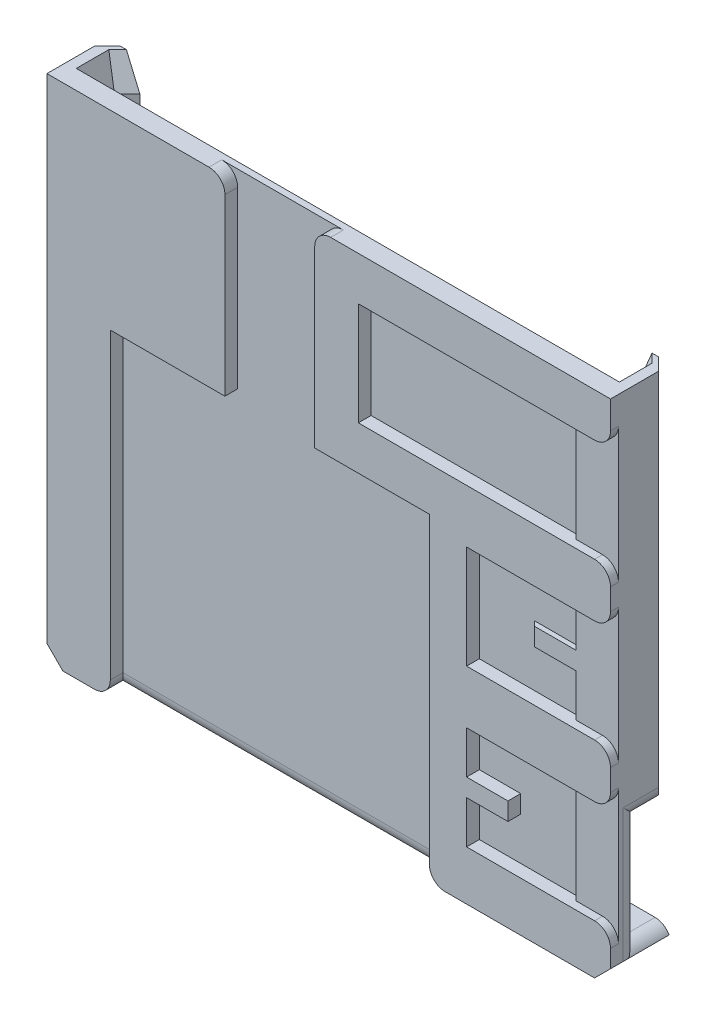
ISO-10303-21;
HEADER;
FILE_DESCRIPTION(('STEP AP214'),'2;1');
FILE_NAME('part.step','',(''),(''),'','','');
FILE_SCHEMA(('AUTOMOTIVE_DESIGN { 1 0 10303 214 1 1 1 1 }'));
ENDSEC;
DATA;
#1=APPLICATION_CONTEXT('core data for automotive mechanical design processes');
#2=APPLICATION_PROTOCOL_DEFINITION('international standard','automotive_design',2000,#1);
#3=PRODUCT_CONTEXT('',#1,'mechanical');
#4=PRODUCT('Part','Part','',(#3));
#5=PRODUCT_RELATED_PRODUCT_CATEGORY('part','',(#4));
#6=PRODUCT_DEFINITION_FORMATION('','',#4);
#7=PRODUCT_DEFINITION_CONTEXT('part definition',#1,'design');
#8=PRODUCT_DEFINITION('design','',#6,#7);
#9=PRODUCT_DEFINITION_SHAPE('','',#8);
#10=(LENGTH_UNIT() NAMED_UNIT(*) SI_UNIT(.MILLI.,.METRE.));
#11=(NAMED_UNIT(*) PLANE_ANGLE_UNIT() SI_UNIT($,.RADIAN.));
#12=(NAMED_UNIT(*) SI_UNIT($,.STERADIAN.) SOLID_ANGLE_UNIT());
#13=UNCERTAINTY_MEASURE_WITH_UNIT(LENGTH_MEASURE(1.E-05),#10,'distance_accuracy_value','');
#14=(GEOMETRIC_REPRESENTATION_CONTEXT(3) GLOBAL_UNCERTAINTY_ASSIGNED_CONTEXT((#13)) GLOBAL_UNIT_ASSIGNED_CONTEXT((#10,
#11,#12)) REPRESENTATION_CONTEXT('',''));
#15=CARTESIAN_POINT('',(0.,0.,0.));
#16=DIRECTION('',(0.,0.,1.));
#17=DIRECTION('',(1.,0.,0.));
#18=AXIS2_PLACEMENT_3D('',#15,#16,#17);
#19=CARTESIAN_POINT('',(0.,3.72999999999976,9.));
#20=DIRECTION('',(0.,1.,0.));
#21=DIRECTION('',(0.,0.,1.));
#22=AXIS2_PLACEMENT_3D('',#19,#20,#21);
#23=PLANE('',#22);
#24=DIRECTION('',(1.,0.,0.));
#25=VECTOR('',#24,1.);
#26=CARTESIAN_POINT('',(0.,3.72999999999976,5.));
#27=LINE('',#26,#25);
#28=CARTESIAN_POINT('',(60.7000000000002,3.72999999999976,5.));
#29=VERTEX_POINT('',#28);
#30=CARTESIAN_POINT('',(73.7,3.72999999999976,5.));
#31=VERTEX_POINT('',#30);
#32=EDGE_CURVE('E631',#29,#31,#27,.T.);
#33=ORIENTED_EDGE('',*,*,#32,.F.);
#34=DIRECTION('',(-0.707106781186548,0.,-0.707106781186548));
#35=VECTOR('',#34,1.);
#36=CARTESIAN_POINT('',(32.3500000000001,3.72999999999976,-23.3500000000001));
#37=LINE('',#36,#35);
#38=CARTESIAN_POINT('',(62.2000000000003,3.72999999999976,6.5));
#39=VERTEX_POINT('',#38);
#40=EDGE_CURVE('E851',#29,#39,#37,.F.);
#41=ORIENTED_EDGE('',*,*,#40,.T.);
#42=DIRECTION('',(-1.,0.,0.));
#43=VECTOR('',#42,1.);
#44=CARTESIAN_POINT('',(73.7,3.72999999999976,6.5));
#45=LINE('',#44,#43);
#46=CARTESIAN_POINT('',(75.2,3.72999999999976,6.5));
#47=VERTEX_POINT('',#46);
#48=EDGE_CURVE('E1343',#47,#39,#45,.T.);
#49=ORIENTED_EDGE('',*,*,#48,.F.);
#50=DIRECTION('',(0.707106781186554,0.,0.707106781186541));
#51=VECTOR('',#50,1.);
#52=CARTESIAN_POINT('',(75.2,3.72999999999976,6.5));
#53=LINE('',#52,#51);
#54=EDGE_CURVE('E872',#47,#31,#53,.F.);
#55=ORIENTED_EDGE('',*,*,#54,.T.);
#56=EDGE_LOOP('',(#33,#41,#49,#55));
#57=FACE_BOUND('',#56,.T.);
#58=ADVANCED_FACE('F45',(#57),#23,.T.);
#59=CARTESIAN_POINT('',(0.,-1.87000000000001,9.));
#60=DIRECTION('',(0.,-1.,0.));
#61=DIRECTION('',(1.,0.,0.));
#62=AXIS2_PLACEMENT_3D('',#59,#60,#61);
#63=PLANE('',#62);
#64=DIRECTION('',(1.,0.,0.));
#65=VECTOR('',#64,1.);
#66=CARTESIAN_POINT('',(60.7000000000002,-1.87,6.5));
#67=LINE('',#66,#65);
#68=CARTESIAN_POINT('',(62.2000000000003,-1.87,6.5));
#69=VERTEX_POINT('',#68);
#70=CARTESIAN_POINT('',(75.2,-1.87,6.5));
#71=VERTEX_POINT('',#70);
#72=EDGE_CURVE('E1347',#69,#71,#67,.T.);
#73=ORIENTED_EDGE('',*,*,#72,.F.);
#74=DIRECTION('',(0.707106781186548,0.,0.707106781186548));
#75=VECTOR('',#74,1.);
#76=CARTESIAN_POINT('',(32.3500000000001,-1.87,-23.3500000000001));
#77=LINE('',#76,#75);
#78=CARTESIAN_POINT('',(60.7000000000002,-1.87,5.));
#79=VERTEX_POINT('',#78);
#80=EDGE_CURVE('E848',#69,#79,#77,.F.);
#81=ORIENTED_EDGE('',*,*,#80,.T.);
#82=DIRECTION('',(-1.,0.,0.));
#83=VECTOR('',#82,1.);
#84=CARTESIAN_POINT('',(0.,-1.87000000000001,5.));
#85=LINE('',#84,#83);
#86=CARTESIAN_POINT('',(73.7,-1.87,5.));
#87=VERTEX_POINT('',#86);
#88=EDGE_CURVE('E639',#87,#79,#85,.T.);
#89=ORIENTED_EDGE('',*,*,#88,.F.);
#90=DIRECTION('',(-0.707106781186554,0.,-0.707106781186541));
#91=VECTOR('',#90,1.);
#92=CARTESIAN_POINT('',(75.2,-1.87,6.5));
#93=LINE('',#92,#91);
#94=EDGE_CURVE('E868',#87,#71,#93,.F.);
#95=ORIENTED_EDGE('',*,*,#94,.T.);
#96=EDGE_LOOP('',(#73,#81,#89,#95));
#97=FACE_BOUND('',#96,.T.);
#98=ADVANCED_FACE('F1421',(#97),#63,.T.);
#99=CARTESIAN_POINT('',(0.,0.,5.));
#100=DIRECTION('',(0.,0.,-1.));
#101=DIRECTION('',(-1.,0.,0.));
#102=AXIS2_PLACEMENT_3D('',#99,#100,#101);
#103=PLANE('',#102);
#104=DIRECTION('',(0.,-1.,0.));
#105=VECTOR('',#104,1.);
#106=CARTESIAN_POINT('',(-68.6,0.,5.));
#107=LINE('',#106,#105);
#108=CARTESIAN_POINT('',(-68.6,20.2,5.));
#109=VERTEX_POINT('',#108);
#110=CARTESIAN_POINT('',(-68.6,-75.,5.));
#111=VERTEX_POINT('',#110);
#112=EDGE_CURVE('E674',#109,#111,#107,.T.);
#113=ORIENTED_EDGE('',*,*,#112,.T.);
#114=DIRECTION('',(1.,0.,0.));
#115=VECTOR('',#114,1.);
#116=CARTESIAN_POINT('',(0.,-75.,5.));
#117=LINE('',#116,#115);
#118=CARTESIAN_POINT('',(31.6,-75.,5.));
#119=VERTEX_POINT('',#118);
#120=EDGE_CURVE('E1083',#111,#119,#117,.T.);
#121=ORIENTED_EDGE('',*,*,#120,.T.);
#122=DIRECTION('',(0.,-1.,0.));
#123=VECTOR('',#122,1.);
#124=CARTESIAN_POINT('',(31.6,0.,5.));
#125=LINE('',#124,#123);
#126=CARTESIAN_POINT('',(31.6,20.2,5.));
#127=VERTEX_POINT('',#126);
#128=EDGE_CURVE('E512',#127,#119,#125,.T.);
#129=ORIENTED_EDGE('',*,*,#128,.F.);
#130=DIRECTION('',(1.,0.,0.));
#131=VECTOR('',#130,1.);
#132=CARTESIAN_POINT('',(0.,20.2,5.));
#133=LINE('',#132,#131);
#134=CARTESIAN_POINT('',(-4.39999999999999,20.2,5.));
#135=VERTEX_POINT('',#134);
#136=EDGE_CURVE('E659',#135,#127,#133,.T.);
#137=ORIENTED_EDGE('',*,*,#136,.F.);
#138=DIRECTION('',(0.,-1.,0.));
#139=VECTOR('',#138,1.);
#140=CARTESIAN_POINT('',(-4.39999999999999,0.,5.));
#141=LINE('',#140,#139);
#142=CARTESIAN_POINT('',(-4.4,75.,5.));
#143=VERTEX_POINT('',#142);
#144=EDGE_CURVE('E509',#143,#135,#141,.T.);
#145=ORIENTED_EDGE('',*,*,#144,.F.);
#146=CARTESIAN_POINT('',(0.600000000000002,75.,5.));
#147=DIRECTION('',(0.,0.,-1.));
#148=DIRECTION('',(-1.,0.,0.));
#149=AXIS2_PLACEMENT_3D('',#146,#147,#148);
#150=CIRCLE('',#149,5.);
#151=CARTESIAN_POINT('',(0.600000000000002,80.,5.));
#152=VERTEX_POINT('',#151);
#153=EDGE_CURVE('E1127',#143,#152,#150,.T.);
#154=ORIENTED_EDGE('',*,*,#153,.T.);
#155=DIRECTION('',(-1.,0.,0.));
#156=VECTOR('',#155,1.);
#157=CARTESIAN_POINT('',(-88.5,80.,5.));
#158=LINE('',#157,#156);
#159=CARTESIAN_POINT('',(-37.6,80.,5.));
#160=VERTEX_POINT('',#159);
#161=EDGE_CURVE('E810',#152,#160,#158,.T.);
#162=ORIENTED_EDGE('',*,*,#161,.T.);
#163=CARTESIAN_POINT('',(-37.6,75.,5.));
#164=DIRECTION('',(0.,0.,-1.));
#165=DIRECTION('',(-1.,0.,0.));
#166=AXIS2_PLACEMENT_3D('',#163,#164,#165);
#167=CIRCLE('',#166,5.);
#168=CARTESIAN_POINT('',(-32.6,75.,5.));
#169=VERTEX_POINT('',#168);
#170=EDGE_CURVE('E1124',#160,#169,#167,.T.);
#171=ORIENTED_EDGE('',*,*,#170,.T.);
#172=DIRECTION('',(0.,1.,0.));
#173=VECTOR('',#172,1.);
#174=CARTESIAN_POINT('',(-32.6,0.,5.));
#175=LINE('',#174,#173);
#176=CARTESIAN_POINT('',(-32.6,20.2,5.));
#177=VERTEX_POINT('',#176);
#178=EDGE_CURVE('E706',#177,#169,#175,.T.);
#179=ORIENTED_EDGE('',*,*,#178,.F.);
#180=DIRECTION('',(1.,0.,0.));
#181=VECTOR('',#180,1.);
#182=CARTESIAN_POINT('',(0.,20.2,5.));
#183=LINE('',#182,#181);
#184=EDGE_CURVE('E726',#109,#177,#183,.T.);
#185=ORIENTED_EDGE('',*,*,#184,.F.);
#186=EDGE_LOOP('',(#113,#121,#129,#137,#145,#154,#162,#171,#179,#185));
#187=FACE_BOUND('',#186,.T.);
#188=ADVANCED_FACE('F1427',(#187),#103,.F.);
#189=CARTESIAN_POINT('',(0.,0.,0.));
#190=DIRECTION('',(0.,0.,-1.));
#191=DIRECTION('',(-1.,0.,0.));
#192=AXIS2_PLACEMENT_3D('',#189,#190,#191);
#193=PLANE('',#192);
#194=DIRECTION('',(1.,0.,0.));
#195=VECTOR('',#194,1.);
#196=CARTESIAN_POINT('',(-88.5000000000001,-73.,0.));
#197=LINE('',#196,#195);
#198=CARTESIAN_POINT('',(-83.5,-73.,0.));
#199=VERTEX_POINT('',#198);
#200=CARTESIAN_POINT('',(83.5,-73.,0.));
#201=VERTEX_POINT('',#200);
#202=EDGE_CURVE('E1326',#199,#201,#197,.T.);
#203=ORIENTED_EDGE('',*,*,#202,.F.);
#204=DIRECTION('',(0.,-1.,0.));
#205=VECTOR('',#204,1.);
#206=CARTESIAN_POINT('',(-83.5,-38.2,0.));
#207=LINE('',#206,#205);
#208=CARTESIAN_POINT('',(-83.5,-38.2,0.));
#209=VERTEX_POINT('',#208);
#210=EDGE_CURVE('E1041',#199,#209,#207,.F.);
#211=ORIENTED_EDGE('',*,*,#210,.T.);
#212=DIRECTION('',(-1.,0.,0.));
#213=VECTOR('',#212,1.);
#214=CARTESIAN_POINT('',(0.,-38.2,0.));
#215=LINE('',#214,#213);
#216=CARTESIAN_POINT('',(83.5,-38.2,0.));
#217=VERTEX_POINT('',#216);
#218=EDGE_CURVE('E816',#217,#209,#215,.T.);
#219=ORIENTED_EDGE('',*,*,#218,.F.);
#220=DIRECTION('',(0.,-1.,0.));
#221=VECTOR('',#220,1.);
#222=CARTESIAN_POINT('',(83.5,0.,0.));
#223=LINE('',#222,#221);
#224=EDGE_CURVE('E1037',#217,#201,#223,.T.);
#225=ORIENTED_EDGE('',*,*,#224,.T.);
#226=EDGE_LOOP('',(#203,#211,#219,#225));
#227=FACE_BOUND('',#226,.T.);
#228=ADVANCED_FACE('F1915',(#227),#193,.T.);
#229=CARTESIAN_POINT('',(-88.5,80.,5.));
#230=DIRECTION('',(0.,-1.,0.));
#231=DIRECTION('',(0.,0.,-1.));
#232=AXIS2_PLACEMENT_3D('',#229,#230,#231);
#233=PLANE('',#232);
#234=DIRECTION('',(-1.,0.,0.));
#235=VECTOR('',#234,1.);
#236=CARTESIAN_POINT('',(0.,80.,9.));
#237=LINE('',#236,#235);
#238=CARTESIAN_POINT('',(-37.6,80.,9.));
#239=VERTEX_POINT('',#238);
#240=CARTESIAN_POINT('',(-88.5,80.,9.));
#241=VERTEX_POINT('',#240);
#242=EDGE_CURVE('E713',#239,#241,#237,.T.);
#243=ORIENTED_EDGE('',*,*,#242,.F.);
#244=DIRECTION('',(0.,0.,-1.));
#245=VECTOR('',#244,1.);
#246=CARTESIAN_POINT('',(-37.6,80.,5.));
#247=LINE('',#246,#245);
#248=EDGE_CURVE('E1092',#239,#160,#247,.T.);
#249=ORIENTED_EDGE('',*,*,#248,.T.);
#250=ORIENTED_EDGE('',*,*,#161,.F.);
#251=DIRECTION('',(0.,0.,-1.));
#252=VECTOR('',#251,1.);
#253=CARTESIAN_POINT('',(0.600000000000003,80.,5.));
#254=LINE('',#253,#252);
#255=CARTESIAN_POINT('',(0.600000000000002,80.,9.));
#256=VERTEX_POINT('',#255);
#257=EDGE_CURVE('E1089',#152,#256,#254,.F.);
#258=ORIENTED_EDGE('',*,*,#257,.T.);
#259=DIRECTION('',(-1.,0.,0.));
#260=VECTOR('',#259,1.);
#261=CARTESIAN_POINT('',(0.,80.,9.));
#262=LINE('',#261,#260);
#263=CARTESIAN_POINT('',(88.5,80.,9.));
#264=VERTEX_POINT('',#263);
#265=EDGE_CURVE('E573',#264,#256,#262,.T.);
#266=ORIENTED_EDGE('',*,*,#265,.F.);
#267=DIRECTION('',(0.,0.,-1.));
#268=VECTOR('',#267,1.);
#269=CARTESIAN_POINT('',(88.5,80.,5.));
#270=LINE('',#269,#268);
#271=CARTESIAN_POINT('',(88.5,80.,-6.));
#272=VERTEX_POINT('',#271);
#273=EDGE_CURVE('E766',#264,#272,#270,.T.);
#274=ORIENTED_EDGE('',*,*,#273,.T.);
#275=DIRECTION('',(-0.707106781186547,0.,-0.707106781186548));
#276=VECTOR('',#275,1.);
#277=CARTESIAN_POINT('',(88.5,80.,-6.));
#278=LINE('',#277,#276);
#279=CARTESIAN_POINT('',(84.5,80.,-10.));
#280=VERTEX_POINT('',#279);
#281=EDGE_CURVE('E744',#272,#280,#278,.T.);
#282=ORIENTED_EDGE('',*,*,#281,.T.);
#283=DIRECTION('',(-1.,0.,0.));
#284=VECTOR('',#283,1.);
#285=CARTESIAN_POINT('',(78.3,80.,-10.));
#286=LINE('',#285,#284);
#287=CARTESIAN_POINT('',(82.5426406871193,80.,-10.));
#288=VERTEX_POINT('',#287);
#289=EDGE_CURVE('E756',#288,#280,#286,.F.);
#290=ORIENTED_EDGE('',*,*,#289,.F.);
#291=DIRECTION('',(0.707106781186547,0.,0.707106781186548));
#292=VECTOR('',#291,1.);
#293=CARTESIAN_POINT('',(84.4213203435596,80.,-8.12132034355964));
#294=LINE('',#293,#292);
#295=CARTESIAN_POINT('',(85.3,80.,-7.24264068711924));
#296=VERTEX_POINT('',#295);
#297=EDGE_CURVE('E900',#288,#296,#294,.T.);
#298=ORIENTED_EDGE('',*,*,#297,.T.);
#299=DIRECTION('',(0.,0.,1.));
#300=VECTOR('',#299,1.);
#301=CARTESIAN_POINT('',(85.3,80.,0.));
#302=LINE('',#301,#300);
#303=CARTESIAN_POINT('',(85.3,80.,3.00000000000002));
#304=VERTEX_POINT('',#303);
#305=EDGE_CURVE('E893',#296,#304,#302,.T.);
#306=ORIENTED_EDGE('',*,*,#305,.T.);
#307=DIRECTION('',(-1.,0.,0.));
#308=VECTOR('',#307,1.);
#309=CARTESIAN_POINT('',(-85.3,80.,3.00000000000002));
#310=LINE('',#309,#308);
#311=CARTESIAN_POINT('',(-85.3,80.,3.00000000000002));
#312=VERTEX_POINT('',#311);
#313=EDGE_CURVE('E896',#304,#312,#310,.T.);
#314=ORIENTED_EDGE('',*,*,#313,.T.);
#315=DIRECTION('',(0.,0.,-1.));
#316=VECTOR('',#315,1.);
#317=CARTESIAN_POINT('',(-85.3,80.,5.));
#318=LINE('',#317,#316);
#319=CARTESIAN_POINT('',(-85.3,80.,-7.24264068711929));
#320=VERTEX_POINT('',#319);
#321=EDGE_CURVE('E890',#312,#320,#318,.T.);
#322=ORIENTED_EDGE('',*,*,#321,.T.);
#323=DIRECTION('',(0.707106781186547,0.,-0.707106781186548));
#324=VECTOR('',#323,1.);
#325=CARTESIAN_POINT('',(-80.4213203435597,80.,-12.1213203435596));
#326=LINE('',#325,#324);
#327=CARTESIAN_POINT('',(-82.5426406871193,80.,-10.));
#328=VERTEX_POINT('',#327);
#329=EDGE_CURVE('E903',#320,#328,#326,.T.);
#330=ORIENTED_EDGE('',*,*,#329,.T.);
#331=DIRECTION('',(1.,0.,0.));
#332=VECTOR('',#331,1.);
#333=CARTESIAN_POINT('',(-78.3,80.,-10.));
#334=LINE('',#333,#332);
#335=CARTESIAN_POINT('',(-84.5,80.,-9.99999999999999));
#336=VERTEX_POINT('',#335);
#337=EDGE_CURVE('E799',#336,#328,#334,.T.);
#338=ORIENTED_EDGE('',*,*,#337,.F.);
#339=DIRECTION('',(0.707106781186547,0.,-0.707106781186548));
#340=VECTOR('',#339,1.);
#341=CARTESIAN_POINT('',(-88.5,80.,-6.));
#342=LINE('',#341,#340);
#343=CARTESIAN_POINT('',(-88.5,80.,-6.));
#344=VERTEX_POINT('',#343);
#345=EDGE_CURVE('E795',#344,#336,#342,.T.);
#346=ORIENTED_EDGE('',*,*,#345,.F.);
#347=DIRECTION('',(0.,0.,-1.));
#348=VECTOR('',#347,1.);
#349=CARTESIAN_POINT('',(-88.5,80.,5.));
#350=LINE('',#349,#348);
#351=EDGE_CURVE('E813',#241,#344,#350,.T.);
#352=ORIENTED_EDGE('',*,*,#351,.F.);
#353=EDGE_LOOP('',(#243,#249,#250,#258,#266,#274,#282,#290,#298,#306,#314,#322,#330,#338,#346,#352));
#354=FACE_BOUND('',#353,.T.);
#355=ADVANCED_FACE('F1196',(#354),#233,.F.);
#356=CARTESIAN_POINT('',(-88.5,-80.,5.));
#357=DIRECTION('',(1.,0.,0.));
#358=DIRECTION('',(0.,1.,0.));
#359=AXIS2_PLACEMENT_3D('',#356,#357,#358);
#360=PLANE('',#359);
#361=DIRECTION('',(0.,-1.,0.));
#362=VECTOR('',#361,1.);
#363=CARTESIAN_POINT('',(-88.5,-73.,5.));
#364=LINE('',#363,#362);
#365=CARTESIAN_POINT('',(-88.5,-33.2,5.));
#366=VERTEX_POINT('',#365);
#367=CARTESIAN_POINT('',(-88.5,-75.,5.));
#368=VERTEX_POINT('',#367);
#369=EDGE_CURVE('E1027',#366,#368,#364,.T.);
#370=ORIENTED_EDGE('',*,*,#369,.T.);
#371=DIRECTION('',(0.,0.,1.));
#372=VECTOR('',#371,1.);
#373=CARTESIAN_POINT('',(-88.5,-75.,5.));
#374=LINE('',#373,#372);
#375=CARTESIAN_POINT('',(-88.5,-75.,9.));
#376=VERTEX_POINT('',#375);
#377=EDGE_CURVE('E55',#368,#376,#374,.T.);
#378=ORIENTED_EDGE('',*,*,#377,.T.);
#379=DIRECTION('',(0.,-1.,0.));
#380=VECTOR('',#379,1.);
#381=CARTESIAN_POINT('',(-88.5,0.,9.));
#382=LINE('',#381,#380);
#383=EDGE_CURVE('E716',#241,#376,#382,.T.);
#384=ORIENTED_EDGE('',*,*,#383,.F.);
#385=ORIENTED_EDGE('',*,*,#351,.T.);
#386=DIRECTION('',(0.,-1.,0.));
#387=VECTOR('',#386,1.);
#388=CARTESIAN_POINT('',(-88.5,0.,-6.));
#389=LINE('',#388,#387);
#390=CARTESIAN_POINT('',(-88.5,-33.2,-6.));
#391=VERTEX_POINT('',#390);
#392=EDGE_CURVE('E806',#344,#391,#389,.T.);
#393=ORIENTED_EDGE('',*,*,#392,.T.);
#394=DIRECTION('',(0.,0.,1.));
#395=VECTOR('',#394,1.);
#396=CARTESIAN_POINT('',(-88.5,-33.2,0.));
#397=LINE('',#396,#395);
#398=EDGE_CURVE('E1024',#391,#366,#397,.T.);
#399=ORIENTED_EDGE('',*,*,#398,.T.);
#400=EDGE_LOOP('',(#370,#378,#384,#385,#393,#399));
#401=FACE_BOUND('',#400,.T.);
#402=ADVANCED_FACE('F1307',(#401),#360,.F.);
#403=CARTESIAN_POINT('',(-88.5,-80.,5.));
#404=DIRECTION('',(0.,1.,0.));
#405=DIRECTION('',(-1.,0.,0.));
#406=AXIS2_PLACEMENT_3D('',#403,#404,#405);
#407=PLANE('',#406);
#408=DIRECTION('',(1.,0.,0.));
#409=VECTOR('',#408,1.);
#410=CARTESIAN_POINT('',(-88.5000000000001,-80.,-10.));
#411=LINE('',#410,#409);
#412=CARTESIAN_POINT('',(-83.4999999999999,-80.,-10.));
#413=VERTEX_POINT('',#412);
#414=CARTESIAN_POINT('',(83.4999999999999,-80.,-10.));
#415=VERTEX_POINT('',#414);
#416=EDGE_CURVE('E943',#413,#415,#411,.T.);
#417=ORIENTED_EDGE('',*,*,#416,.T.);
#418=DIRECTION('',(0.,0.,1.));
#419=VECTOR('',#418,1.);
#420=CARTESIAN_POINT('',(83.4999999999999,-80.,9.));
#421=LINE('',#420,#419);
#422=CARTESIAN_POINT('',(83.4999999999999,-80.,9.));
#423=VERTEX_POINT('',#422);
#424=EDGE_CURVE('E1170',#415,#423,#421,.T.);
#425=ORIENTED_EDGE('',*,*,#424,.T.);
#426=DIRECTION('',(1.,0.,0.));
#427=VECTOR('',#426,1.);
#428=CARTESIAN_POINT('',(0.,-80.,9.));
#429=LINE('',#428,#427);
#430=CARTESIAN_POINT('',(36.6,-80.,9.));
#431=VERTEX_POINT('',#430);
#432=EDGE_CURVE('E566',#431,#423,#429,.T.);
#433=ORIENTED_EDGE('',*,*,#432,.F.);
#434=DIRECTION('',(0.,0.,-1.));
#435=VECTOR('',#434,1.);
#436=CARTESIAN_POINT('',(36.6,-80.,5.));
#437=LINE('',#436,#435);
#438=CARTESIAN_POINT('',(36.6,-80.,0.));
#439=VERTEX_POINT('',#438);
#440=EDGE_CURVE('E1067',#431,#439,#437,.T.);
#441=ORIENTED_EDGE('',*,*,#440,.T.);
#442=DIRECTION('',(1.,0.,0.));
#443=VECTOR('',#442,1.);
#444=CARTESIAN_POINT('',(-88.5,-80.,0.));
#445=LINE('',#444,#443);
#446=CARTESIAN_POINT('',(-73.6,-80.,0.));
#447=VERTEX_POINT('',#446);
#448=EDGE_CURVE('E1070',#439,#447,#445,.F.);
#449=ORIENTED_EDGE('',*,*,#448,.T.);
#450=DIRECTION('',(0.,0.,-1.));
#451=VECTOR('',#450,1.);
#452=CARTESIAN_POINT('',(-73.6,-80.,9.));
#453=LINE('',#452,#451);
#454=CARTESIAN_POINT('',(-73.6,-80.,9.));
#455=VERTEX_POINT('',#454);
#456=EDGE_CURVE('E1073',#447,#455,#453,.F.);
#457=ORIENTED_EDGE('',*,*,#456,.T.);
#458=DIRECTION('',(1.,0.,0.));
#459=VECTOR('',#458,1.);
#460=CARTESIAN_POINT('',(0.,-80.,9.));
#461=LINE('',#460,#459);
#462=CARTESIAN_POINT('',(-83.4999999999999,-80.,9.));
#463=VERTEX_POINT('',#462);
#464=EDGE_CURVE('E719',#463,#455,#461,.T.);
#465=ORIENTED_EDGE('',*,*,#464,.F.);
#466=DIRECTION('',(0.,0.,-1.));
#467=VECTOR('',#466,1.);
#468=CARTESIAN_POINT('',(-83.4999999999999,-80.,5.));
#469=LINE('',#468,#467);
#470=EDGE_CURVE('E1166',#463,#413,#469,.T.);
#471=ORIENTED_EDGE('',*,*,#470,.T.);
#472=EDGE_LOOP('',(#417,#425,#433,#441,#449,#457,#465,#471));
#473=FACE_BOUND('',#472,.T.);
#474=ADVANCED_FACE('F1222',(#473),#407,.F.);
#475=DIRECTION('',(0.,1.,0.));
#476=VECTOR('',#475,1.);
#477=CARTESIAN_POINT('',(-82.3,0.,0.));
#478=LINE('',#477,#476);
#479=CARTESIAN_POINT('',(-82.3,-31.7000000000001,0.));
#480=VERTEX_POINT('',#479);
#481=CARTESIAN_POINT('',(-82.3,69.9999999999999,0.));
#482=VERTEX_POINT('',#481);
#483=EDGE_CURVE('E820',#480,#482,#478,.T.);
#484=ORIENTED_EDGE('',*,*,#483,.T.);
#485=DIRECTION('',(1.,0.,0.));
#486=VECTOR('',#485,1.);
#487=CARTESIAN_POINT('',(82.3,69.9999999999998,0.));
#488=LINE('',#487,#486);
#489=CARTESIAN_POINT('',(82.3,69.9999999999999,0.));
#490=VERTEX_POINT('',#489);
#491=EDGE_CURVE('E920',#482,#490,#488,.T.);
#492=ORIENTED_EDGE('',*,*,#491,.T.);
#493=DIRECTION('',(0.,1.,0.));
#494=VECTOR('',#493,1.);
#495=CARTESIAN_POINT('',(82.3,0.,0.));
#496=LINE('',#495,#494);
#497=CARTESIAN_POINT('',(82.3,-31.7000000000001,0.));
#498=VERTEX_POINT('',#497);
#499=EDGE_CURVE('E824',#498,#490,#496,.T.);
#500=ORIENTED_EDGE('',*,*,#499,.F.);
#501=DIRECTION('',(1.,0.,0.));
#502=VECTOR('',#501,1.);
#503=CARTESIAN_POINT('',(-88.5000000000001,-31.7000000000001,0.));
#504=LINE('',#503,#502);
#505=EDGE_CURVE('E775',#480,#498,#504,.T.);
#506=ORIENTED_EDGE('',*,*,#505,.F.);
#507=EDGE_LOOP('',(#484,#492,#500,#506));
#508=FACE_BOUND('',#507,.T.);
#509=ADVANCED_FACE('F1273',(#508),#193,.T.);
#510=CARTESIAN_POINT('',(-82.3,0.,-6.));
#511=DIRECTION('',(-1.,0.,0.));
#512=DIRECTION('',(0.,-1.,0.));
#513=AXIS2_PLACEMENT_3D('',#510,#511,#512);
#514=PLANE('',#513);
#515=DIRECTION('',(0.,-1.,0.));
#516=VECTOR('',#515,1.);
#517=CARTESIAN_POINT('',(-82.3,0.,-6.));
#518=LINE('',#517,#516);
#519=CARTESIAN_POINT('',(-82.3,69.9999999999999,-6.));
#520=VERTEX_POINT('',#519);
#521=CARTESIAN_POINT('',(-82.3,-31.7000000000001,-6.));
#522=VERTEX_POINT('',#521);
#523=EDGE_CURVE('E803',#520,#522,#518,.T.);
#524=ORIENTED_EDGE('',*,*,#523,.F.);
#525=DIRECTION('',(0.,0.,1.));
#526=VECTOR('',#525,1.);
#527=CARTESIAN_POINT('',(-82.3,69.9999999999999,-6.));
#528=LINE('',#527,#526);
#529=EDGE_CURVE('E886',#520,#482,#528,.T.);
#530=ORIENTED_EDGE('',*,*,#529,.T.);
#531=ORIENTED_EDGE('',*,*,#483,.F.);
#532=DIRECTION('',(0.,0.,-1.));
#533=VECTOR('',#532,1.);
#534=CARTESIAN_POINT('',(-82.3,-31.7000000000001,-6.));
#535=LINE('',#534,#533);
#536=EDGE_CURVE('E785',#480,#522,#535,.T.);
#537=ORIENTED_EDGE('',*,*,#536,.T.);
#538=EDGE_LOOP('',(#524,#530,#531,#537));
#539=FACE_BOUND('',#538,.T.);
#540=ADVANCED_FACE('F1270',(#539),#514,.F.);
#541=CARTESIAN_POINT('',(0.,-38.2,-6.));
#542=DIRECTION('',(0.,-1.,0.));
#543=DIRECTION('',(0.,0.,-1.));
#544=AXIS2_PLACEMENT_3D('',#541,#542,#543);
#545=PLANE('',#544);
#546=ORIENTED_EDGE('',*,*,#218,.T.);
#547=DIRECTION('',(0.,0.,1.));
#548=VECTOR('',#547,1.);
#549=CARTESIAN_POINT('',(-83.5,-38.2,-6.));
#550=LINE('',#549,#548);
#551=CARTESIAN_POINT('',(-83.5,-38.2000000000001,-10.));
#552=VERTEX_POINT('',#551);
#553=EDGE_CURVE('E1048',#209,#552,#550,.F.);
#554=ORIENTED_EDGE('',*,*,#553,.T.);
#555=DIRECTION('',(-1.,0.,0.));
#556=VECTOR('',#555,1.);
#557=CARTESIAN_POINT('',(0.,-38.2,-10.));
#558=LINE('',#557,#556);
#559=CARTESIAN_POINT('',(83.5,-38.1999999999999,-10.));
#560=VERTEX_POINT('',#559);
#561=EDGE_CURVE('E770',#560,#552,#558,.T.);
#562=ORIENTED_EDGE('',*,*,#561,.F.);
#563=DIRECTION('',(0.,0.,1.));
#564=VECTOR('',#563,1.);
#565=CARTESIAN_POINT('',(83.5,-38.2,-6.));
#566=LINE('',#565,#564);
#567=EDGE_CURVE('E1044',#560,#217,#566,.T.);
#568=ORIENTED_EDGE('',*,*,#567,.T.);
#569=EDGE_LOOP('',(#546,#554,#562,#568));
#570=FACE_BOUND('',#569,.T.);
#571=ADVANCED_FACE('F1942',(#570),#545,.T.);
#572=CARTESIAN_POINT('',(3.99999999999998,0.,-10.));
#573=DIRECTION('',(0.,0.,-1.));
#574=DIRECTION('',(-1.,0.,0.));
#575=AXIS2_PLACEMENT_3D('',#572,#573,#574);
#576=PLANE('',#575);
#577=ORIENTED_EDGE('',*,*,#561,.T.);
#578=CARTESIAN_POINT('',(-83.5,-33.2,-10.));
#579=DIRECTION('',(0.,0.,-1.));
#580=DIRECTION('',(-1.,0.,0.));
#581=AXIS2_PLACEMENT_3D('',#578,#579,#580);
#582=CIRCLE('',#581,5.);
#583=CARTESIAN_POINT('',(-84.5,-38.0989794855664,-10.));
#584=VERTEX_POINT('',#583);
#585=EDGE_CURVE('E1054',#552,#584,#582,.T.);
#586=ORIENTED_EDGE('',*,*,#585,.T.);
#587=DIRECTION('',(0.,1.,0.));
#588=VECTOR('',#587,1.);
#589=CARTESIAN_POINT('',(-84.5,80.,-10.));
#590=LINE('',#589,#588);
#591=EDGE_CURVE('E792',#584,#336,#590,.T.);
#592=ORIENTED_EDGE('',*,*,#591,.T.);
#593=ORIENTED_EDGE('',*,*,#337,.T.);
#594=DIRECTION('',(0.390566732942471,-0.920574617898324,0.));
#595=VECTOR('',#594,1.);
#596=CARTESIAN_POINT('',(-40.5775552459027,-18.9126549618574,-10.));
#597=LINE('',#596,#595);
#598=CARTESIAN_POINT('',(-78.3,69.9999999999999,-10.));
#599=VERTEX_POINT('',#598);
#600=EDGE_CURVE('E910',#328,#599,#597,.T.);
#601=ORIENTED_EDGE('',*,*,#600,.T.);
#602=DIRECTION('',(0.,-1.,0.));
#603=VECTOR('',#602,1.);
#604=CARTESIAN_POINT('',(-78.3,80.,-10.));
#605=LINE('',#604,#603);
#606=CARTESIAN_POINT('',(-78.3,-31.7000000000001,-10.));
#607=VERTEX_POINT('',#606);
#608=EDGE_CURVE('E789',#599,#607,#605,.T.);
#609=ORIENTED_EDGE('',*,*,#608,.T.);
#610=DIRECTION('',(-1.,0.,0.));
#611=VECTOR('',#610,1.);
#612=CARTESIAN_POINT('',(0.,-31.7,-10.));
#613=LINE('',#612,#611);
#614=CARTESIAN_POINT('',(78.3,-31.7000000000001,-10.));
#615=VERTEX_POINT('',#614);
#616=EDGE_CURVE('E771',#615,#607,#613,.T.);
#617=ORIENTED_EDGE('',*,*,#616,.F.);
#618=DIRECTION('',(0.,-1.,0.));
#619=VECTOR('',#618,1.);
#620=CARTESIAN_POINT('',(78.3,80.,-10.));
#621=LINE('',#620,#619);
#622=CARTESIAN_POINT('',(78.3,69.9999999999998,-10.));
#623=VERTEX_POINT('',#622);
#624=EDGE_CURVE('E749',#615,#623,#621,.F.);
#625=ORIENTED_EDGE('',*,*,#624,.T.);
#626=DIRECTION('',(0.390566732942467,0.920574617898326,0.));
#627=VECTOR('',#626,1.);
#628=CARTESIAN_POINT('',(41.797894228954,-16.0362883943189,-10.));
#629=LINE('',#628,#627);
#630=EDGE_CURVE('E907',#623,#288,#629,.T.);
#631=ORIENTED_EDGE('',*,*,#630,.T.);
#632=ORIENTED_EDGE('',*,*,#289,.T.);
#633=DIRECTION('',(0.,1.,0.));
#634=VECTOR('',#633,1.);
#635=CARTESIAN_POINT('',(84.5,80.,-10.));
#636=LINE('',#635,#634);
#637=CARTESIAN_POINT('',(84.5,-38.0989794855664,-10.));
#638=VERTEX_POINT('',#637);
#639=EDGE_CURVE('E745',#280,#638,#636,.F.);
#640=ORIENTED_EDGE('',*,*,#639,.T.);
#641=CARTESIAN_POINT('',(83.5,-33.2,-10.));
#642=DIRECTION('',(0.,0.,-1.));
#643=DIRECTION('',(-1.,0.,0.));
#644=AXIS2_PLACEMENT_3D('',#641,#642,#643);
#645=CIRCLE('',#644,5.);
#646=EDGE_CURVE('E1051',#638,#560,#645,.T.);
#647=ORIENTED_EDGE('',*,*,#646,.T.);
#648=EDGE_LOOP('',(#577,#586,#592,#593,#601,#609,#617,#625,#631,#632,#640,#647));
#649=FACE_BOUND('',#648,.T.);
#650=ADVANCED_FACE('F1286',(#649),#576,.T.);
#651=CARTESIAN_POINT('',(-82.3,80.,-6.));
#652=DIRECTION('',(0.707106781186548,0.,0.707106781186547));
#653=DIRECTION('',(0.707106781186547,0.,-0.707106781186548));
#654=AXIS2_PLACEMENT_3D('',#651,#652,#653);
#655=PLANE('',#654);
#656=ORIENTED_EDGE('',*,*,#608,.F.);
#657=DIRECTION('',(-0.707106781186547,0.,0.707106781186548));
#658=VECTOR('',#657,1.);
#659=CARTESIAN_POINT('',(-85.3,69.9999999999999,-2.99999999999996));
#660=LINE('',#659,#658);
#661=EDGE_CURVE('E913',#599,#520,#660,.T.);
#662=ORIENTED_EDGE('',*,*,#661,.T.);
#663=ORIENTED_EDGE('',*,*,#523,.T.);
#664=DIRECTION('',(-0.707106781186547,0.,0.707106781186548));
#665=VECTOR('',#664,1.);
#666=CARTESIAN_POINT('',(-82.2999999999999,-31.7000000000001,-6.00000000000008));
#667=LINE('',#666,#665);
#668=EDGE_CURVE('E778',#607,#522,#667,.T.);
#669=ORIENTED_EDGE('',*,*,#668,.F.);
#670=EDGE_LOOP('',(#656,#662,#663,#669));
#671=FACE_BOUND('',#670,.T.);
#672=ADVANCED_FACE('F1290',(#671),#655,.T.);
#673=CARTESIAN_POINT('',(-88.5,80.,-6.));
#674=DIRECTION('',(-0.707106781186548,0.,-0.707106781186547));
#675=DIRECTION('',(-0.707106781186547,0.,0.707106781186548));
#676=AXIS2_PLACEMENT_3D('',#673,#674,#675);
#677=PLANE('',#676);
#678=ORIENTED_EDGE('',*,*,#591,.F.);
#679=CARTESIAN_POINT('',(-83.5,-33.2,-11.));
#680=DIRECTION('',(-0.707106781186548,0.,-0.707106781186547));
#681=DIRECTION('',(0.707106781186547,0.,-0.707106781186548));
#682=AXIS2_PLACEMENT_3D('',#679,#680,#681);
#683=ELLIPSE('',#682,7.07106781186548,5.);
#684=EDGE_CURVE('E1057',#584,#391,#683,.T.);
#685=ORIENTED_EDGE('',*,*,#684,.T.);
#686=ORIENTED_EDGE('',*,*,#392,.F.);
#687=ORIENTED_EDGE('',*,*,#345,.T.);
#688=EDGE_LOOP('',(#678,#685,#686,#687));
#689=FACE_BOUND('',#688,.T.);
#690=ADVANCED_FACE('F1300',(#689),#677,.T.);
#691=CARTESIAN_POINT('',(0.,-31.7,0.));
#692=DIRECTION('',(0.,1.,0.));
#693=DIRECTION('',(-1.,0.,0.));
#694=AXIS2_PLACEMENT_3D('',#691,#692,#693);
#695=PLANE('',#694);
#696=ORIENTED_EDGE('',*,*,#536,.F.);
#697=ORIENTED_EDGE('',*,*,#505,.T.);
#698=DIRECTION('',(0.,0.,-1.));
#699=VECTOR('',#698,1.);
#700=CARTESIAN_POINT('',(82.3,-31.7000000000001,-6.));
#701=LINE('',#700,#699);
#702=CARTESIAN_POINT('',(82.3,-31.7000000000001,-6.));
#703=VERTEX_POINT('',#702);
#704=EDGE_CURVE('E740',#498,#703,#701,.T.);
#705=ORIENTED_EDGE('',*,*,#704,.T.);
#706=DIRECTION('',(-0.707106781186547,0.,-0.707106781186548));
#707=VECTOR('',#706,1.);
#708=CARTESIAN_POINT('',(82.2999999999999,-31.7000000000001,-6.00000000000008));
#709=LINE('',#708,#707);
#710=EDGE_CURVE('E828',#703,#615,#709,.T.);
#711=ORIENTED_EDGE('',*,*,#710,.T.);
#712=ORIENTED_EDGE('',*,*,#616,.T.);
#713=ORIENTED_EDGE('',*,*,#668,.T.);
#714=EDGE_LOOP('',(#696,#697,#705,#711,#712,#713));
#715=FACE_BOUND('',#714,.T.);
#716=ADVANCED_FACE('F1277',(#715),#695,.T.);
#717=CARTESIAN_POINT('',(88.5,-80.,5.));
#718=DIRECTION('',(1.,0.,0.));
#719=DIRECTION('',(0.,1.,0.));
#720=AXIS2_PLACEMENT_3D('',#717,#718,#719);
#721=PLANE('',#720);
#722=DIRECTION('',(0.,1.,0.));
#723=VECTOR('',#722,1.);
#724=CARTESIAN_POINT('',(88.5,0.,9.));
#725=LINE('',#724,#723);
#726=CARTESIAN_POINT('',(88.5,-74.9999999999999,9.));
#727=VERTEX_POINT('',#726);
#728=CARTESIAN_POINT('',(88.5,-69.44,9.));
#729=VERTEX_POINT('',#728);
#730=EDGE_CURVE('E570',#727,#729,#725,.T.);
#731=ORIENTED_EDGE('',*,*,#730,.F.);
#732=DIRECTION('',(0.,0.,-1.));
#733=VECTOR('',#732,1.);
#734=CARTESIAN_POINT('',(88.5,-74.9999999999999,-10.));
#735=LINE('',#734,#733);
#736=CARTESIAN_POINT('',(88.5,-74.9999999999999,5.));
#737=VERTEX_POINT('',#736);
#738=EDGE_CURVE('E1131',#727,#737,#735,.T.);
#739=ORIENTED_EDGE('',*,*,#738,.T.);
#740=DIRECTION('',(0.,-1.,0.));
#741=VECTOR('',#740,1.);
#742=CARTESIAN_POINT('',(88.5,-80.,5.));
#743=LINE('',#742,#741);
#744=CARTESIAN_POINT('',(88.5,-33.2,5.));
#745=VERTEX_POINT('',#744);
#746=EDGE_CURVE('E933',#737,#745,#743,.F.);
#747=ORIENTED_EDGE('',*,*,#746,.T.);
#748=DIRECTION('',(0.,0.,1.));
#749=VECTOR('',#748,1.);
#750=CARTESIAN_POINT('',(88.5,-33.2,5.));
#751=LINE('',#750,#749);
#752=CARTESIAN_POINT('',(88.5,-33.2,-6.));
#753=VERTEX_POINT('',#752);
#754=EDGE_CURVE('E946',#745,#753,#751,.F.);
#755=ORIENTED_EDGE('',*,*,#754,.T.);
#756=DIRECTION('',(0.,-1.,0.));
#757=VECTOR('',#756,1.);
#758=CARTESIAN_POINT('',(88.5,0.,-6.));
#759=LINE('',#758,#757);
#760=EDGE_CURVE('E762',#272,#753,#759,.T.);
#761=ORIENTED_EDGE('',*,*,#760,.F.);
#762=ORIENTED_EDGE('',*,*,#273,.F.);
#763=CARTESIAN_POINT('',(88.5,71.3,9.));
#764=VERTEX_POINT('',#763);
#765=EDGE_CURVE('E569',#764,#264,#725,.T.);
#766=ORIENTED_EDGE('',*,*,#765,.F.);
#767=DIRECTION('',(0.,0.,1.));
#768=VECTOR('',#767,1.);
#769=CARTESIAN_POINT('',(88.5,71.3,6.5));
#770=LINE('',#769,#768);
#771=CARTESIAN_POINT('',(88.5,71.3,6.5));
#772=VERTEX_POINT('',#771);
#773=EDGE_CURVE('E949',#764,#772,#770,.F.);
#774=ORIENTED_EDGE('',*,*,#773,.T.);
#775=DIRECTION('',(0.,1.,0.));
#776=VECTOR('',#775,1.);
#777=CARTESIAN_POINT('',(88.5,33.9,6.5));
#778=LINE('',#777,#776);
#779=CARTESIAN_POINT('',(88.5,28.9,6.5));
#780=VERTEX_POINT('',#779);
#781=EDGE_CURVE('E1334',#780,#772,#778,.T.);
#782=ORIENTED_EDGE('',*,*,#781,.F.);
#783=DIRECTION('',(0.,0.,1.));
#784=VECTOR('',#783,1.);
#785=CARTESIAN_POINT('',(88.5,28.9,5.));
#786=LINE('',#785,#784);
#787=CARTESIAN_POINT('',(88.5,28.9,9.));
#788=VERTEX_POINT('',#787);
#789=EDGE_CURVE('E953',#780,#788,#786,.T.);
#790=ORIENTED_EDGE('',*,*,#789,.T.);
#791=CARTESIAN_POINT('',(88.5,22.13,9.));
#792=VERTEX_POINT('',#791);
#793=EDGE_CURVE('E575',#792,#788,#725,.T.);
#794=ORIENTED_EDGE('',*,*,#793,.F.);
#795=DIRECTION('',(0.,0.,1.));
#796=VECTOR('',#795,1.);
#797=CARTESIAN_POINT('',(88.5,22.13,5.));
#798=LINE('',#797,#796);
#799=CARTESIAN_POINT('',(88.5,22.13,6.5));
#800=VERTEX_POINT('',#799);
#801=EDGE_CURVE('E957',#792,#800,#798,.F.);
#802=ORIENTED_EDGE('',*,*,#801,.T.);
#803=DIRECTION('',(0.,1.,0.));
#804=VECTOR('',#803,1.);
#805=CARTESIAN_POINT('',(88.5,-15.27,6.5));
#806=LINE('',#805,#804);
#807=CARTESIAN_POINT('',(88.5,-20.27,6.5));
#808=VERTEX_POINT('',#807);
#809=EDGE_CURVE('E1335',#808,#800,#806,.T.);
#810=ORIENTED_EDGE('',*,*,#809,.F.);
#811=DIRECTION('',(0.,0.,1.));
#812=VECTOR('',#811,1.);
#813=CARTESIAN_POINT('',(88.5,-20.27,5.));
#814=LINE('',#813,#812);
#815=CARTESIAN_POINT('',(88.5,-20.27,9.));
#816=VERTEX_POINT('',#815);
#817=EDGE_CURVE('E961',#808,#816,#814,.T.);
#818=ORIENTED_EDGE('',*,*,#817,.T.);
#819=CARTESIAN_POINT('',(88.5,-27.04,9.));
#820=VERTEX_POINT('',#819);
#821=EDGE_CURVE('E574',#820,#816,#725,.T.);
#822=ORIENTED_EDGE('',*,*,#821,.F.);
#823=DIRECTION('',(0.,0.,1.));
#824=VECTOR('',#823,1.);
#825=CARTESIAN_POINT('',(88.5,-27.04,5.));
#826=LINE('',#825,#824);
#827=CARTESIAN_POINT('',(88.5,-27.04,6.5));
#828=VERTEX_POINT('',#827);
#829=EDGE_CURVE('E965',#820,#828,#826,.F.);
#830=ORIENTED_EDGE('',*,*,#829,.T.);
#831=DIRECTION('',(0.,1.,0.));
#832=VECTOR('',#831,1.);
#833=CARTESIAN_POINT('',(88.5,-64.44,6.5));
#834=LINE('',#833,#832);
#835=CARTESIAN_POINT('',(88.5,-69.44,6.5));
#836=VERTEX_POINT('',#835);
#837=EDGE_CURVE('E515',#836,#828,#834,.T.);
#838=ORIENTED_EDGE('',*,*,#837,.F.);
#839=DIRECTION('',(0.,0.,1.));
#840=VECTOR('',#839,1.);
#841=CARTESIAN_POINT('',(88.5,-69.44,5.));
#842=LINE('',#841,#840);
#843=EDGE_CURVE('E969',#836,#729,#842,.T.);
#844=ORIENTED_EDGE('',*,*,#843,.T.);
#845=EDGE_LOOP('',(#731,#739,#747,#755,#761,#762,#766,#774,#782,#790,#794,#802,#810,#818,#822,
#830,#838,#844));
#846=FACE_BOUND('',#845,.T.);
#847=ADVANCED_FACE('F1192',(#846),#721,.T.);
#848=CARTESIAN_POINT('',(82.3,0.,-6.));
#849=DIRECTION('',(-1.,0.,0.));
#850=DIRECTION('',(0.,-1.,0.));
#851=AXIS2_PLACEMENT_3D('',#848,#849,#850);
#852=PLANE('',#851);
#853=ORIENTED_EDGE('',*,*,#499,.T.);
#854=DIRECTION('',(0.,0.,-1.));
#855=VECTOR('',#854,1.);
#856=CARTESIAN_POINT('',(82.3,69.9999999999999,-6.));
#857=LINE('',#856,#855);
#858=CARTESIAN_POINT('',(82.3,69.9999999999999,-6.));
#859=VERTEX_POINT('',#858);
#860=EDGE_CURVE('E923',#490,#859,#857,.T.);
#861=ORIENTED_EDGE('',*,*,#860,.T.);
#862=DIRECTION('',(0.,-1.,0.));
#863=VECTOR('',#862,1.);
#864=CARTESIAN_POINT('',(82.3,0.,-6.));
#865=LINE('',#864,#863);
#866=EDGE_CURVE('E759',#859,#703,#865,.T.);
#867=ORIENTED_EDGE('',*,*,#866,.T.);
#868=ORIENTED_EDGE('',*,*,#704,.F.);
#869=EDGE_LOOP('',(#853,#861,#867,#868));
#870=FACE_BOUND('',#869,.T.);
#871=ADVANCED_FACE('F1279',(#870),#852,.T.);
#872=CARTESIAN_POINT('',(88.5,80.,-6.));
#873=DIRECTION('',(0.707106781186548,0.,-0.707106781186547));
#874=DIRECTION('',(-0.707106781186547,0.,-0.707106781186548));
#875=AXIS2_PLACEMENT_3D('',#872,#873,#874);
#876=PLANE('',#875);
#877=ORIENTED_EDGE('',*,*,#760,.T.);
#878=CARTESIAN_POINT('',(83.5,-33.2,-11.));
#879=DIRECTION('',(0.707106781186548,0.,-0.707106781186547));
#880=DIRECTION('',(0.707106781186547,0.,0.707106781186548));
#881=AXIS2_PLACEMENT_3D('',#878,#879,#880);
#882=ELLIPSE('',#881,7.07106781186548,5.);
#883=EDGE_CURVE('E1060',#753,#638,#882,.T.);
#884=ORIENTED_EDGE('',*,*,#883,.T.);
#885=ORIENTED_EDGE('',*,*,#639,.F.);
#886=ORIENTED_EDGE('',*,*,#281,.F.);
#887=EDGE_LOOP('',(#877,#884,#885,#886));
#888=FACE_BOUND('',#887,.T.);
#889=ADVANCED_FACE('F1244',(#888),#876,.T.);
#890=CARTESIAN_POINT('',(82.3,80.,-6.));
#891=DIRECTION('',(-0.707106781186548,0.,0.707106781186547));
#892=DIRECTION('',(0.707106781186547,0.,0.707106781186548));
#893=AXIS2_PLACEMENT_3D('',#890,#891,#892);
#894=PLANE('',#893);
#895=ORIENTED_EDGE('',*,*,#866,.F.);
#896=DIRECTION('',(-0.707106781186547,0.,-0.707106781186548));
#897=VECTOR('',#896,1.);
#898=CARTESIAN_POINT('',(78.3,69.9999999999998,-10.));
#899=LINE('',#898,#897);
#900=EDGE_CURVE('E916',#859,#623,#899,.T.);
#901=ORIENTED_EDGE('',*,*,#900,.T.);
#902=ORIENTED_EDGE('',*,*,#624,.F.);
#903=ORIENTED_EDGE('',*,*,#710,.F.);
#904=EDGE_LOOP('',(#895,#901,#902,#903));
#905=FACE_BOUND('',#904,.T.);
#906=ADVANCED_FACE('F1284',(#905),#894,.T.);
#907=CARTESIAN_POINT('',(-68.6,0.,9.));
#908=DIRECTION('',(1.,0.,0.));
#909=DIRECTION('',(0.,1.,0.));
#910=AXIS2_PLACEMENT_3D('',#907,#908,#909);
#911=PLANE('',#910);
#912=DIRECTION('',(0.,-1.,0.));
#913=VECTOR('',#912,1.);
#914=CARTESIAN_POINT('',(-68.6,0.,9.));
#915=LINE('',#914,#913);
#916=CARTESIAN_POINT('',(-68.6,20.2,9.));
#917=VERTEX_POINT('',#916);
#918=CARTESIAN_POINT('',(-68.6,-75.,9.));
#919=VERTEX_POINT('',#918);
#920=EDGE_CURVE('E701',#917,#919,#915,.T.);
#921=ORIENTED_EDGE('',*,*,#920,.T.);
#922=DIRECTION('',(0.,0.,-1.));
#923=VECTOR('',#922,1.);
#924=CARTESIAN_POINT('',(-68.6,-75.,5.));
#925=LINE('',#924,#923);
#926=EDGE_CURVE('E1063',#919,#111,#925,.T.);
#927=ORIENTED_EDGE('',*,*,#926,.T.);
#928=ORIENTED_EDGE('',*,*,#112,.F.);
#929=DIRECTION('',(0.,0.,-1.));
#930=VECTOR('',#929,1.);
#931=CARTESIAN_POINT('',(-68.6,20.2,9.));
#932=LINE('',#931,#930);
#933=EDGE_CURVE('E736',#917,#109,#932,.T.);
#934=ORIENTED_EDGE('',*,*,#933,.F.);
#935=EDGE_LOOP('',(#921,#927,#928,#934));
#936=FACE_BOUND('',#935,.T.);
#937=ADVANCED_FACE('F1988',(#936),#911,.T.);
#938=CARTESIAN_POINT('',(0.,20.2,9.));
#939=DIRECTION('',(0.,1.,0.));
#940=DIRECTION('',(-1.,0.,0.));
#941=AXIS2_PLACEMENT_3D('',#938,#939,#940);
#942=PLANE('',#941);
#943=ORIENTED_EDGE('',*,*,#184,.T.);
#944=DIRECTION('',(0.,0.,-1.));
#945=VECTOR('',#944,1.);
#946=CARTESIAN_POINT('',(-32.6,20.2,9.));
#947=LINE('',#946,#945);
#948=CARTESIAN_POINT('',(-32.6,20.2,9.));
#949=VERTEX_POINT('',#948);
#950=EDGE_CURVE('E722',#949,#177,#947,.T.);
#951=ORIENTED_EDGE('',*,*,#950,.F.);
#952=DIRECTION('',(1.,0.,0.));
#953=VECTOR('',#952,1.);
#954=CARTESIAN_POINT('',(0.,20.2,9.));
#955=LINE('',#954,#953);
#956=EDGE_CURVE('E705',#917,#949,#955,.T.);
#957=ORIENTED_EDGE('',*,*,#956,.F.);
#958=ORIENTED_EDGE('',*,*,#933,.T.);
#959=EDGE_LOOP('',(#943,#951,#957,#958));
#960=FACE_BOUND('',#959,.T.);
#961=ADVANCED_FACE('F1999',(#960),#942,.F.);
#962=CARTESIAN_POINT('',(-32.6,0.,9.));
#963=DIRECTION('',(-1.,0.,0.));
#964=DIRECTION('',(0.,0.,1.));
#965=AXIS2_PLACEMENT_3D('',#962,#963,#964);
#966=PLANE('',#965);
#967=ORIENTED_EDGE('',*,*,#178,.T.);
#968=DIRECTION('',(0.,0.,-1.));
#969=VECTOR('',#968,1.);
#970=CARTESIAN_POINT('',(-32.6,75.,9.));
#971=LINE('',#970,#969);
#972=CARTESIAN_POINT('',(-32.6,75.,9.));
#973=VERTEX_POINT('',#972);
#974=EDGE_CURVE('E1096',#169,#973,#971,.F.);
#975=ORIENTED_EDGE('',*,*,#974,.T.);
#976=DIRECTION('',(0.,1.,0.));
#977=VECTOR('',#976,1.);
#978=CARTESIAN_POINT('',(-32.6,0.,9.));
#979=LINE('',#978,#977);
#980=EDGE_CURVE('E709',#949,#973,#979,.T.);
#981=ORIENTED_EDGE('',*,*,#980,.F.);
#982=ORIENTED_EDGE('',*,*,#950,.T.);
#983=EDGE_LOOP('',(#967,#975,#981,#982));
#984=FACE_BOUND('',#983,.T.);
#985=ADVANCED_FACE('F2006',(#984),#966,.F.);
#986=CARTESIAN_POINT('',(0.,0.,9.));
#987=DIRECTION('',(0.,0.,1.));
#988=DIRECTION('',(1.,0.,0.));
#989=AXIS2_PLACEMENT_3D('',#986,#987,#988);
#990=PLANE('',#989);
#991=ORIENTED_EDGE('',*,*,#383,.T.);
#992=DIRECTION('',(-0.707106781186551,0.707106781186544,0.));
#993=VECTOR('',#992,1.);
#994=CARTESIAN_POINT('',(-81.7499999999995,-81.7500000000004,9.));
#995=LINE('',#994,#993);
#996=EDGE_CURVE('E11',#376,#463,#995,.F.);
#997=ORIENTED_EDGE('',*,*,#996,.T.);
#998=ORIENTED_EDGE('',*,*,#464,.T.);
#999=CARTESIAN_POINT('',(-73.6,-75.,9.));
#1000=DIRECTION('',(0.,0.,1.));
#1001=DIRECTION('',(1.,0.,0.));
#1002=AXIS2_PLACEMENT_3D('',#999,#1000,#1001);
#1003=CIRCLE('',#1002,5.);
#1004=EDGE_CURVE('E1080',#455,#919,#1003,.T.);
#1005=ORIENTED_EDGE('',*,*,#1004,.T.);
#1006=ORIENTED_EDGE('',*,*,#920,.F.);
#1007=ORIENTED_EDGE('',*,*,#956,.T.);
#1008=ORIENTED_EDGE('',*,*,#980,.T.);
#1009=CARTESIAN_POINT('',(-37.6,75.,9.));
#1010=DIRECTION('',(0.,0.,1.));
#1011=DIRECTION('',(1.,0.,0.));
#1012=AXIS2_PLACEMENT_3D('',#1009,#1010,#1011);
#1013=CIRCLE('',#1012,5.);
#1014=EDGE_CURVE('E1077',#973,#239,#1013,.T.);
#1015=ORIENTED_EDGE('',*,*,#1014,.T.);
#1016=ORIENTED_EDGE('',*,*,#242,.T.);
#1017=EDGE_LOOP('',(#991,#997,#998,#1005,#1006,#1007,#1008,#1015,#1016));
#1018=FACE_BOUND('',#1017,.T.);
#1019=ADVANCED_FACE('F1312',(#1018),#990,.T.);
#1020=CARTESIAN_POINT('',(0.,20.2,9.));
#1021=DIRECTION('',(0.,1.,0.));
#1022=DIRECTION('',(-1.,0.,0.));
#1023=AXIS2_PLACEMENT_3D('',#1020,#1021,#1022);
#1024=PLANE('',#1023);
#1025=ORIENTED_EDGE('',*,*,#136,.T.);
#1026=DIRECTION('',(0.,0.,-1.));
#1027=VECTOR('',#1026,1.);
#1028=CARTESIAN_POINT('',(31.6,20.2,9.));
#1029=LINE('',#1028,#1027);
#1030=CARTESIAN_POINT('',(31.6,20.2,9.));
#1031=VERTEX_POINT('',#1030);
#1032=EDGE_CURVE('E670',#1031,#127,#1029,.T.);
#1033=ORIENTED_EDGE('',*,*,#1032,.F.);
#1034=DIRECTION('',(1.,0.,0.));
#1035=VECTOR('',#1034,1.);
#1036=CARTESIAN_POINT('',(0.,20.2,9.));
#1037=LINE('',#1036,#1035);
#1038=CARTESIAN_POINT('',(-4.39999999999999,20.2,9.));
#1039=VERTEX_POINT('',#1038);
#1040=EDGE_CURVE('E558',#1039,#1031,#1037,.T.);
#1041=ORIENTED_EDGE('',*,*,#1040,.F.);
#1042=DIRECTION('',(0.,0.,-1.));
#1043=VECTOR('',#1042,1.);
#1044=CARTESIAN_POINT('',(-4.39999999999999,20.2,9.));
#1045=LINE('',#1044,#1043);
#1046=EDGE_CURVE('E666',#1039,#135,#1045,.T.);
#1047=ORIENTED_EDGE('',*,*,#1046,.T.);
#1048=EDGE_LOOP('',(#1025,#1033,#1041,#1047));
#1049=FACE_BOUND('',#1048,.T.);
#1050=ADVANCED_FACE('F1210',(#1049),#1024,.F.);
#1051=CARTESIAN_POINT('',(31.6,0.,9.));
#1052=DIRECTION('',(1.,0.,0.));
#1053=DIRECTION('',(0.,0.,-1.));
#1054=AXIS2_PLACEMENT_3D('',#1051,#1052,#1053);
#1055=PLANE('',#1054);
#1056=ORIENTED_EDGE('',*,*,#128,.T.);
#1057=DIRECTION('',(0.,0.,-1.));
#1058=VECTOR('',#1057,1.);
#1059=CARTESIAN_POINT('',(31.6,-75.,9.));
#1060=LINE('',#1059,#1058);
#1061=CARTESIAN_POINT('',(31.6,-75.,9.));
#1062=VERTEX_POINT('',#1061);
#1063=EDGE_CURVE('E1086',#119,#1062,#1060,.F.);
#1064=ORIENTED_EDGE('',*,*,#1063,.T.);
#1065=DIRECTION('',(0.,-1.,0.));
#1066=VECTOR('',#1065,1.);
#1067=CARTESIAN_POINT('',(31.6,0.,9.));
#1068=LINE('',#1067,#1066);
#1069=EDGE_CURVE('E562',#1031,#1062,#1068,.T.);
#1070=ORIENTED_EDGE('',*,*,#1069,.F.);
#1071=ORIENTED_EDGE('',*,*,#1032,.T.);
#1072=EDGE_LOOP('',(#1056,#1064,#1070,#1071));
#1073=FACE_BOUND('',#1072,.T.);
#1074=ADVANCED_FACE('F1889',(#1073),#1055,.F.);
#1075=CARTESIAN_POINT('',(0.,-15.27,9.));
#1076=DIRECTION('',(0.,1.,0.));
#1077=DIRECTION('',(0.,0.,1.));
#1078=AXIS2_PLACEMENT_3D('',#1075,#1076,#1077);
#1079=PLANE('',#1078);
#1080=DIRECTION('',(1.,0.,0.));
#1081=VECTOR('',#1080,1.);
#1082=CARTESIAN_POINT('',(0.,-15.27,9.));
#1083=LINE('',#1082,#1081);
#1084=CARTESIAN_POINT('',(43.3,-15.27,9.));
#1085=VERTEX_POINT('',#1084);
#1086=CARTESIAN_POINT('',(83.5,-15.27,9.));
#1087=VERTEX_POINT('',#1086);
#1088=EDGE_CURVE('E547',#1085,#1087,#1083,.T.);
#1089=ORIENTED_EDGE('',*,*,#1088,.T.);
#1090=DIRECTION('',(0.,0.,1.));
#1091=VECTOR('',#1090,1.);
#1092=CARTESIAN_POINT('',(83.5,-15.27,9.));
#1093=LINE('',#1092,#1091);
#1094=CARTESIAN_POINT('',(83.5,-15.27,6.5));
#1095=VERTEX_POINT('',#1094);
#1096=EDGE_CURVE('E1003',#1087,#1095,#1093,.F.);
#1097=ORIENTED_EDGE('',*,*,#1096,.T.);
#1098=DIRECTION('',(1.,0.,0.));
#1099=VECTOR('',#1098,1.);
#1100=CARTESIAN_POINT('',(73.7,-15.27,6.5));
#1101=LINE('',#1100,#1099);
#1102=CARTESIAN_POINT('',(75.2,-15.27,6.5));
#1103=VERTEX_POINT('',#1102);
#1104=EDGE_CURVE('E1350',#1103,#1095,#1101,.T.);
#1105=ORIENTED_EDGE('',*,*,#1104,.F.);
#1106=DIRECTION('',(0.707106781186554,0.,0.707106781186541));
#1107=VECTOR('',#1106,1.);
#1108=CARTESIAN_POINT('',(75.2,-15.27,6.5));
#1109=LINE('',#1108,#1107);
#1110=CARTESIAN_POINT('',(73.7,-15.27,5.));
#1111=VERTEX_POINT('',#1110);
#1112=EDGE_CURVE('E865',#1103,#1111,#1109,.F.);
#1113=ORIENTED_EDGE('',*,*,#1112,.T.);
#1114=DIRECTION('',(1.,0.,0.));
#1115=VECTOR('',#1114,1.);
#1116=CARTESIAN_POINT('',(0.,-15.27,5.));
#1117=LINE('',#1116,#1115);
#1118=CARTESIAN_POINT('',(43.3,-15.27,5.));
#1119=VERTEX_POINT('',#1118);
#1120=EDGE_CURVE('E647',#1119,#1111,#1117,.T.);
#1121=ORIENTED_EDGE('',*,*,#1120,.F.);
#1122=DIRECTION('',(0.,0.,-1.));
#1123=VECTOR('',#1122,1.);
#1124=CARTESIAN_POINT('',(43.3,-15.27,9.));
#1125=LINE('',#1124,#1123);
#1126=EDGE_CURVE('E671',#1085,#1119,#1125,.T.);
#1127=ORIENTED_EDGE('',*,*,#1126,.F.);
#1128=EDGE_LOOP('',(#1089,#1097,#1105,#1113,#1121,#1127));
#1129=FACE_BOUND('',#1128,.T.);
#1130=ADVANCED_FACE('F1882',(#1129),#1079,.T.);
#1131=CARTESIAN_POINT('',(43.3,0.,9.));
#1132=DIRECTION('',(1.,0.,0.));
#1133=DIRECTION('',(0.,1.,0.));
#1134=AXIS2_PLACEMENT_3D('',#1131,#1132,#1133);
#1135=PLANE('',#1134);
#1136=DIRECTION('',(0.,-1.,0.));
#1137=VECTOR('',#1136,1.);
#1138=CARTESIAN_POINT('',(43.3,0.,5.));
#1139=LINE('',#1138,#1137);
#1140=CARTESIAN_POINT('',(43.3,17.13,5.));
#1141=VERTEX_POINT('',#1140);
#1142=EDGE_CURVE('E651',#1141,#1119,#1139,.T.);
#1143=ORIENTED_EDGE('',*,*,#1142,.F.);
#1144=DIRECTION('',(0.,0.,-1.));
#1145=VECTOR('',#1144,1.);
#1146=CARTESIAN_POINT('',(43.3,17.13,9.));
#1147=LINE('',#1146,#1145);
#1148=CARTESIAN_POINT('',(43.3,17.13,9.));
#1149=VERTEX_POINT('',#1148);
#1150=EDGE_CURVE('E675',#1149,#1141,#1147,.T.);
#1151=ORIENTED_EDGE('',*,*,#1150,.F.);
#1152=DIRECTION('',(0.,-1.,0.));
#1153=VECTOR('',#1152,1.);
#1154=CARTESIAN_POINT('',(43.3,0.,9.));
#1155=LINE('',#1154,#1153);
#1156=EDGE_CURVE('E551',#1149,#1085,#1155,.T.);
#1157=ORIENTED_EDGE('',*,*,#1156,.T.);
#1158=ORIENTED_EDGE('',*,*,#1126,.T.);
#1159=EDGE_LOOP('',(#1143,#1151,#1157,#1158));
#1160=FACE_BOUND('',#1159,.T.);
#1161=ADVANCED_FACE('F1888',(#1160),#1135,.T.);
#1162=CARTESIAN_POINT('',(0.,-51.04,9.));
#1163=DIRECTION('',(0.,-1.,0.));
#1164=DIRECTION('',(0.,0.,-1.));
#1165=AXIS2_PLACEMENT_3D('',#1162,#1163,#1164);
#1166=PLANE('',#1165);
#1167=DIRECTION('',(-1.,0.,0.));
#1168=VECTOR('',#1167,1.);
#1169=CARTESIAN_POINT('',(0.,-51.04,5.));
#1170=LINE('',#1169,#1168);
#1171=CARTESIAN_POINT('',(56.3,-51.04,5.));
#1172=VERTEX_POINT('',#1171);
#1173=CARTESIAN_POINT('',(43.3,-51.04,5.));
#1174=VERTEX_POINT('',#1173);
#1175=EDGE_CURVE('E595',#1172,#1174,#1170,.T.);
#1176=ORIENTED_EDGE('',*,*,#1175,.F.);
#1177=DIRECTION('',(0.,0.,-1.));
#1178=VECTOR('',#1177,1.);
#1179=CARTESIAN_POINT('',(56.3,-51.04,9.));
#1180=LINE('',#1179,#1178);
#1181=CARTESIAN_POINT('',(56.3,-51.04,9.));
#1182=VERTEX_POINT('',#1181);
#1183=EDGE_CURVE('E679',#1182,#1172,#1180,.T.);
#1184=ORIENTED_EDGE('',*,*,#1183,.F.);
#1185=DIRECTION('',(-1.,0.,0.));
#1186=VECTOR('',#1185,1.);
#1187=CARTESIAN_POINT('',(0.,-51.04,9.));
#1188=LINE('',#1187,#1186);
#1189=CARTESIAN_POINT('',(43.3,-51.04,9.));
#1190=VERTEX_POINT('',#1189);
#1191=EDGE_CURVE('E520',#1182,#1190,#1188,.T.);
#1192=ORIENTED_EDGE('',*,*,#1191,.T.);
#1193=DIRECTION('',(0.,0.,-1.));
#1194=VECTOR('',#1193,1.);
#1195=CARTESIAN_POINT('',(43.3,-51.04,9.));
#1196=LINE('',#1195,#1194);
#1197=EDGE_CURVE('E491',#1190,#1174,#1196,.T.);
#1198=ORIENTED_EDGE('',*,*,#1197,.T.);
#1199=EDGE_LOOP('',(#1176,#1184,#1192,#1198));
#1200=FACE_BOUND('',#1199,.T.);
#1201=ADVANCED_FACE('F1406',(#1200),#1166,.T.);
#1202=CARTESIAN_POINT('',(56.3,0.,9.));
#1203=DIRECTION('',(1.,0.,0.));
#1204=DIRECTION('',(0.,0.,-1.));
#1205=AXIS2_PLACEMENT_3D('',#1202,#1203,#1204);
#1206=PLANE('',#1205);
#1207=DIRECTION('',(0.,-1.,0.));
#1208=VECTOR('',#1207,1.);
#1209=CARTESIAN_POINT('',(56.3,0.,5.));
#1210=LINE('',#1209,#1208);
#1211=CARTESIAN_POINT('',(56.3,-45.44,5.));
#1212=VERTEX_POINT('',#1211);
#1213=EDGE_CURVE('E599',#1212,#1172,#1210,.T.);
#1214=ORIENTED_EDGE('',*,*,#1213,.F.);
#1215=DIRECTION('',(0.,0.,-1.));
#1216=VECTOR('',#1215,1.);
#1217=CARTESIAN_POINT('',(56.3,-45.44,9.));
#1218=LINE('',#1217,#1216);
#1219=CARTESIAN_POINT('',(56.3,-45.44,9.));
#1220=VERTEX_POINT('',#1219);
#1221=EDGE_CURVE('E694',#1220,#1212,#1218,.T.);
#1222=ORIENTED_EDGE('',*,*,#1221,.F.);
#1223=DIRECTION('',(0.,-1.,0.));
#1224=VECTOR('',#1223,1.);
#1225=CARTESIAN_POINT('',(56.3,0.,9.));
#1226=LINE('',#1225,#1224);
#1227=EDGE_CURVE('E524',#1220,#1182,#1226,.T.);
#1228=ORIENTED_EDGE('',*,*,#1227,.T.);
#1229=ORIENTED_EDGE('',*,*,#1183,.T.);
#1230=EDGE_LOOP('',(#1214,#1222,#1228,#1229));
#1231=FACE_BOUND('',#1230,.T.);
#1232=ADVANCED_FACE('F1409',(#1231),#1206,.T.);
#1233=CARTESIAN_POINT('',(0.,-45.44,9.));
#1234=DIRECTION('',(0.,1.,0.));
#1235=DIRECTION('',(0.,0.,1.));
#1236=AXIS2_PLACEMENT_3D('',#1233,#1234,#1235);
#1237=PLANE('',#1236);
#1238=DIRECTION('',(1.,0.,0.));
#1239=VECTOR('',#1238,1.);
#1240=CARTESIAN_POINT('',(0.,-45.44,5.));
#1241=LINE('',#1240,#1239);
#1242=CARTESIAN_POINT('',(43.3,-45.44,5.));
#1243=VERTEX_POINT('',#1242);
#1244=EDGE_CURVE('E603',#1243,#1212,#1241,.T.);
#1245=ORIENTED_EDGE('',*,*,#1244,.F.);
#1246=DIRECTION('',(0.,0.,-1.));
#1247=VECTOR('',#1246,1.);
#1248=CARTESIAN_POINT('',(43.3,-45.44,9.));
#1249=LINE('',#1248,#1247);
#1250=CARTESIAN_POINT('',(43.3,-45.44,9.));
#1251=VERTEX_POINT('',#1250);
#1252=EDGE_CURVE('E691',#1251,#1243,#1249,.T.);
#1253=ORIENTED_EDGE('',*,*,#1252,.F.);
#1254=DIRECTION('',(1.,0.,0.));
#1255=VECTOR('',#1254,1.);
#1256=CARTESIAN_POINT('',(0.,-45.44,9.));
#1257=LINE('',#1256,#1255);
#1258=EDGE_CURVE('E528',#1251,#1220,#1257,.T.);
#1259=ORIENTED_EDGE('',*,*,#1258,.T.);
#1260=ORIENTED_EDGE('',*,*,#1221,.T.);
#1261=EDGE_LOOP('',(#1245,#1253,#1259,#1260));
#1262=FACE_BOUND('',#1261,.T.);
#1263=ADVANCED_FACE('F1411',(#1262),#1237,.T.);
#1264=CARTESIAN_POINT('',(43.3,0.,9.));
#1265=DIRECTION('',(1.,0.,0.));
#1266=DIRECTION('',(0.,0.,-1.));
#1267=AXIS2_PLACEMENT_3D('',#1264,#1265,#1266);
#1268=PLANE('',#1267);
#1269=DIRECTION('',(0.,-1.,0.));
#1270=VECTOR('',#1269,1.);
#1271=CARTESIAN_POINT('',(43.3,0.,5.));
#1272=LINE('',#1271,#1270);
#1273=CARTESIAN_POINT('',(43.3,-32.04,5.));
#1274=VERTEX_POINT('',#1273);
#1275=EDGE_CURVE('E607',#1274,#1243,#1272,.T.);
#1276=ORIENTED_EDGE('',*,*,#1275,.F.);
#1277=DIRECTION('',(0.,0.,-1.));
#1278=VECTOR('',#1277,1.);
#1279=CARTESIAN_POINT('',(43.3,-32.04,9.));
#1280=LINE('',#1279,#1278);
#1281=CARTESIAN_POINT('',(43.3,-32.04,9.));
#1282=VERTEX_POINT('',#1281);
#1283=EDGE_CURVE('E688',#1282,#1274,#1280,.T.);
#1284=ORIENTED_EDGE('',*,*,#1283,.F.);
#1285=DIRECTION('',(0.,-1.,0.));
#1286=VECTOR('',#1285,1.);
#1287=CARTESIAN_POINT('',(43.3,0.,9.));
#1288=LINE('',#1287,#1286);
#1289=EDGE_CURVE('E532',#1282,#1251,#1288,.T.);
#1290=ORIENTED_EDGE('',*,*,#1289,.T.);
#1291=ORIENTED_EDGE('',*,*,#1252,.T.);
#1292=EDGE_LOOP('',(#1276,#1284,#1290,#1291));
#1293=FACE_BOUND('',#1292,.T.);
#1294=ADVANCED_FACE('F1383',(#1293),#1268,.T.);
#1295=CARTESIAN_POINT('',(0.,-32.04,9.));
#1296=DIRECTION('',(0.,-1.,0.));
#1297=DIRECTION('',(1.,0.,0.));
#1298=AXIS2_PLACEMENT_3D('',#1295,#1296,#1297);
#1299=PLANE('',#1298);
#1300=DIRECTION('',(-1.,0.,0.));
#1301=VECTOR('',#1300,1.);
#1302=CARTESIAN_POINT('',(88.5,-32.04,6.5));
#1303=LINE('',#1302,#1301);
#1304=CARTESIAN_POINT('',(83.5,-32.04,6.5));
#1305=VERTEX_POINT('',#1304);
#1306=CARTESIAN_POINT('',(75.2,-32.04,6.5));
#1307=VERTEX_POINT('',#1306);
#1308=EDGE_CURVE('E1356',#1305,#1307,#1303,.T.);
#1309=ORIENTED_EDGE('',*,*,#1308,.F.);
#1310=DIRECTION('',(0.,0.,1.));
#1311=VECTOR('',#1310,1.);
#1312=CARTESIAN_POINT('',(83.5,-32.04,9.));
#1313=LINE('',#1312,#1311);
#1314=CARTESIAN_POINT('',(83.5,-32.04,9.));
#1315=VERTEX_POINT('',#1314);
#1316=EDGE_CURVE('E999',#1305,#1315,#1313,.T.);
#1317=ORIENTED_EDGE('',*,*,#1316,.T.);
#1318=DIRECTION('',(-1.,0.,0.));
#1319=VECTOR('',#1318,1.);
#1320=CARTESIAN_POINT('',(0.,-32.04,9.));
#1321=LINE('',#1320,#1319);
#1322=EDGE_CURVE('E536',#1315,#1282,#1321,.T.);
#1323=ORIENTED_EDGE('',*,*,#1322,.T.);
#1324=ORIENTED_EDGE('',*,*,#1283,.T.);
#1325=DIRECTION('',(-1.,0.,0.));
#1326=VECTOR('',#1325,1.);
#1327=CARTESIAN_POINT('',(0.,-32.04,5.));
#1328=LINE('',#1327,#1326);
#1329=CARTESIAN_POINT('',(73.7,-32.04,5.));
#1330=VERTEX_POINT('',#1329);
#1331=EDGE_CURVE('E611',#1330,#1274,#1328,.T.);
#1332=ORIENTED_EDGE('',*,*,#1331,.F.);
#1333=DIRECTION('',(-0.707106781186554,0.,-0.707106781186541));
#1334=VECTOR('',#1333,1.);
#1335=CARTESIAN_POINT('',(75.2,-32.04,6.5));
#1336=LINE('',#1335,#1334);
#1337=EDGE_CURVE('E861',#1330,#1307,#1336,.F.);
#1338=ORIENTED_EDGE('',*,*,#1337,.T.);
#1339=EDGE_LOOP('',(#1309,#1317,#1323,#1324,#1332,#1338));
#1340=FACE_BOUND('',#1339,.T.);
#1341=ADVANCED_FACE('F1376',(#1340),#1299,.T.);
#1342=CARTESIAN_POINT('',(0.,-64.44,9.));
#1343=DIRECTION('',(0.,1.,0.));
#1344=DIRECTION('',(0.,0.,1.));
#1345=AXIS2_PLACEMENT_3D('',#1342,#1343,#1344);
#1346=PLANE('',#1345);
#1347=DIRECTION('',(1.,0.,0.));
#1348=VECTOR('',#1347,1.);
#1349=CARTESIAN_POINT('',(0.,-64.44,9.));
#1350=LINE('',#1349,#1348);
#1351=CARTESIAN_POINT('',(43.3,-64.44,9.));
#1352=VERTEX_POINT('',#1351);
#1353=CARTESIAN_POINT('',(83.5,-64.44,9.));
#1354=VERTEX_POINT('',#1353);
#1355=EDGE_CURVE('E539',#1352,#1354,#1350,.T.);
#1356=ORIENTED_EDGE('',*,*,#1355,.T.);
#1357=DIRECTION('',(0.,0.,1.));
#1358=VECTOR('',#1357,1.);
#1359=CARTESIAN_POINT('',(83.5,-64.44,9.));
#1360=LINE('',#1359,#1358);
#1361=CARTESIAN_POINT('',(83.5,-64.44,6.5));
#1362=VERTEX_POINT('',#1361);
#1363=EDGE_CURVE('E996',#1354,#1362,#1360,.F.);
#1364=ORIENTED_EDGE('',*,*,#1363,.T.);
#1365=DIRECTION('',(1.,0.,0.));
#1366=VECTOR('',#1365,1.);
#1367=CARTESIAN_POINT('',(73.7,-64.44,6.5));
#1368=LINE('',#1367,#1366);
#1369=CARTESIAN_POINT('',(75.2,-64.44,6.5));
#1370=VERTEX_POINT('',#1369);
#1371=EDGE_CURVE('E1358',#1370,#1362,#1368,.T.);
#1372=ORIENTED_EDGE('',*,*,#1371,.F.);
#1373=DIRECTION('',(0.707106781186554,0.,0.707106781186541));
#1374=VECTOR('',#1373,1.);
#1375=CARTESIAN_POINT('',(75.2,-64.44,6.5));
#1376=LINE('',#1375,#1374);
#1377=CARTESIAN_POINT('',(73.7,-64.44,5.));
#1378=VERTEX_POINT('',#1377);
#1379=EDGE_CURVE('E858',#1370,#1378,#1376,.F.);
#1380=ORIENTED_EDGE('',*,*,#1379,.T.);
#1381=DIRECTION('',(1.,0.,0.));
#1382=VECTOR('',#1381,1.);
#1383=CARTESIAN_POINT('',(0.,-64.44,5.));
#1384=LINE('',#1383,#1382);
#1385=CARTESIAN_POINT('',(43.3,-64.44,5.));
#1386=VERTEX_POINT('',#1385);
#1387=EDGE_CURVE('E619',#1386,#1378,#1384,.T.);
#1388=ORIENTED_EDGE('',*,*,#1387,.F.);
#1389=DIRECTION('',(0.,0.,-1.));
#1390=VECTOR('',#1389,1.);
#1391=CARTESIAN_POINT('',(43.3,-64.44,9.));
#1392=LINE('',#1391,#1390);
#1393=EDGE_CURVE('E684',#1352,#1386,#1392,.T.);
#1394=ORIENTED_EDGE('',*,*,#1393,.F.);
#1395=EDGE_LOOP('',(#1356,#1364,#1372,#1380,#1388,#1394));
#1396=FACE_BOUND('',#1395,.T.);
#1397=ADVANCED_FACE('F1393',(#1396),#1346,.T.);
#1398=CARTESIAN_POINT('',(0.,33.9,9.));
#1399=DIRECTION('',(0.,1.,0.));
#1400=DIRECTION('',(0.,0.,1.));
#1401=AXIS2_PLACEMENT_3D('',#1398,#1399,#1400);
#1402=PLANE('',#1401);
#1403=DIRECTION('',(1.,0.,0.));
#1404=VECTOR('',#1403,1.);
#1405=CARTESIAN_POINT('',(0.,33.9,9.));
#1406=LINE('',#1405,#1404);
#1407=CARTESIAN_POINT('',(9.30000000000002,33.9,9.));
#1408=VERTEX_POINT('',#1407);
#1409=CARTESIAN_POINT('',(83.5,33.9,9.));
#1410=VERTEX_POINT('',#1409);
#1411=EDGE_CURVE('E484',#1408,#1410,#1406,.T.);
#1412=ORIENTED_EDGE('',*,*,#1411,.T.);
#1413=DIRECTION('',(0.,0.,1.));
#1414=VECTOR('',#1413,1.);
#1415=CARTESIAN_POINT('',(83.5,33.9,9.));
#1416=LINE('',#1415,#1414);
#1417=CARTESIAN_POINT('',(83.5,33.9,6.5));
#1418=VERTEX_POINT('',#1417);
#1419=EDGE_CURVE('E1010',#1410,#1418,#1416,.F.);
#1420=ORIENTED_EDGE('',*,*,#1419,.T.);
#1421=DIRECTION('',(1.,0.,0.));
#1422=VECTOR('',#1421,1.);
#1423=CARTESIAN_POINT('',(73.7,33.9,6.5));
#1424=LINE('',#1423,#1422);
#1425=CARTESIAN_POINT('',(75.2,33.9,6.5));
#1426=VERTEX_POINT('',#1425);
#1427=EDGE_CURVE('E1330',#1426,#1418,#1424,.T.);
#1428=ORIENTED_EDGE('',*,*,#1427,.F.);
#1429=DIRECTION('',(0.707106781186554,0.,0.707106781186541));
#1430=VECTOR('',#1429,1.);
#1431=CARTESIAN_POINT('',(75.2,33.9,6.5));
#1432=LINE('',#1431,#1430);
#1433=CARTESIAN_POINT('',(73.7,33.9,5.));
#1434=VERTEX_POINT('',#1433);
#1435=EDGE_CURVE('E879',#1426,#1434,#1432,.F.);
#1436=ORIENTED_EDGE('',*,*,#1435,.T.);
#1437=DIRECTION('',(1.,0.,0.));
#1438=VECTOR('',#1437,1.);
#1439=CARTESIAN_POINT('',(0.,33.9,5.));
#1440=LINE('',#1439,#1438);
#1441=CARTESIAN_POINT('',(9.30000000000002,33.9,5.));
#1442=VERTEX_POINT('',#1441);
#1443=EDGE_CURVE('E487',#1442,#1434,#1440,.T.);
#1444=ORIENTED_EDGE('',*,*,#1443,.F.);
#1445=DIRECTION('',(0.,0.,-1.));
#1446=VECTOR('',#1445,1.);
#1447=CARTESIAN_POINT('',(9.30000000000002,33.9,9.));
#1448=LINE('',#1447,#1446);
#1449=EDGE_CURVE('E480',#1408,#1442,#1448,.T.);
#1450=ORIENTED_EDGE('',*,*,#1449,.F.);
#1451=EDGE_LOOP('',(#1412,#1420,#1428,#1436,#1444,#1450));
#1452=FACE_BOUND('',#1451,.T.);
#1453=ADVANCED_FACE('F482',(#1452),#1402,.T.);
#1454=CARTESIAN_POINT('',(9.30000000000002,0.,9.));
#1455=DIRECTION('',(-1.,0.,0.));
#1456=DIRECTION('',(0.,0.,1.));
#1457=AXIS2_PLACEMENT_3D('',#1454,#1455,#1456);
#1458=PLANE('',#1457);
#1459=DIRECTION('',(0.,1.,0.));
#1460=VECTOR('',#1459,1.);
#1461=CARTESIAN_POINT('',(9.30000000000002,0.,5.));
#1462=LINE('',#1461,#1460);
#1463=CARTESIAN_POINT('',(9.30000000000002,66.3,5.));
#1464=VERTEX_POINT('',#1463);
#1465=EDGE_CURVE('E588',#1442,#1464,#1462,.T.);
#1466=ORIENTED_EDGE('',*,*,#1465,.T.);
#1467=DIRECTION('',(0.,0.,-1.));
#1468=VECTOR('',#1467,1.);
#1469=CARTESIAN_POINT('',(9.30000000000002,66.3,9.));
#1470=LINE('',#1469,#1468);
#1471=CARTESIAN_POINT('',(9.30000000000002,66.3,9.));
#1472=VERTEX_POINT('',#1471);
#1473=EDGE_CURVE('E492',#1472,#1464,#1470,.T.);
#1474=ORIENTED_EDGE('',*,*,#1473,.F.);
#1475=DIRECTION('',(0.,1.,0.));
#1476=VECTOR('',#1475,1.);
#1477=CARTESIAN_POINT('',(9.30000000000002,0.,9.));
#1478=LINE('',#1477,#1476);
#1479=EDGE_CURVE('E495',#1408,#1472,#1478,.T.);
#1480=ORIENTED_EDGE('',*,*,#1479,.F.);
#1481=ORIENTED_EDGE('',*,*,#1449,.T.);
#1482=EDGE_LOOP('',(#1466,#1474,#1480,#1481));
#1483=FACE_BOUND('',#1482,.T.);
#1484=ADVANCED_FACE('F496',(#1483),#1458,.F.);
#1485=CARTESIAN_POINT('',(0.,17.13,9.));
#1486=DIRECTION('',(0.,-1.,0.));
#1487=DIRECTION('',(1.,0.,0.));
#1488=AXIS2_PLACEMENT_3D('',#1485,#1486,#1487);
#1489=PLANE('',#1488);
#1490=DIRECTION('',(-1.,0.,0.));
#1491=VECTOR('',#1490,1.);
#1492=CARTESIAN_POINT('',(88.5,17.13,6.5));
#1493=LINE('',#1492,#1491);
#1494=CARTESIAN_POINT('',(83.5,17.13,6.5));
#1495=VERTEX_POINT('',#1494);
#1496=CARTESIAN_POINT('',(75.2,17.13,6.5));
#1497=VERTEX_POINT('',#1496);
#1498=EDGE_CURVE('E1340',#1495,#1497,#1493,.T.);
#1499=ORIENTED_EDGE('',*,*,#1498,.F.);
#1500=DIRECTION('',(0.,0.,1.));
#1501=VECTOR('',#1500,1.);
#1502=CARTESIAN_POINT('',(83.5,17.13,9.));
#1503=LINE('',#1502,#1501);
#1504=CARTESIAN_POINT('',(83.5,17.13,9.));
#1505=VERTEX_POINT('',#1504);
#1506=EDGE_CURVE('E1006',#1495,#1505,#1503,.T.);
#1507=ORIENTED_EDGE('',*,*,#1506,.T.);
#1508=DIRECTION('',(-1.,0.,0.));
#1509=VECTOR('',#1508,1.);
#1510=CARTESIAN_POINT('',(0.,17.13,9.));
#1511=LINE('',#1510,#1509);
#1512=EDGE_CURVE('E555',#1505,#1149,#1511,.T.);
#1513=ORIENTED_EDGE('',*,*,#1512,.T.);
#1514=ORIENTED_EDGE('',*,*,#1150,.T.);
#1515=DIRECTION('',(-1.,0.,0.));
#1516=VECTOR('',#1515,1.);
#1517=CARTESIAN_POINT('',(0.,17.13,5.));
#1518=LINE('',#1517,#1516);
#1519=CARTESIAN_POINT('',(73.7,17.13,5.));
#1520=VERTEX_POINT('',#1519);
#1521=EDGE_CURVE('E655',#1520,#1141,#1518,.T.);
#1522=ORIENTED_EDGE('',*,*,#1521,.F.);
#1523=DIRECTION('',(-0.707106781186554,0.,-0.707106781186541));
#1524=VECTOR('',#1523,1.);
#1525=CARTESIAN_POINT('',(75.2,17.13,6.5));
#1526=LINE('',#1525,#1524);
#1527=EDGE_CURVE('E875',#1520,#1497,#1526,.F.);
#1528=ORIENTED_EDGE('',*,*,#1527,.T.);
#1529=EDGE_LOOP('',(#1499,#1507,#1513,#1514,#1522,#1528));
#1530=FACE_BOUND('',#1529,.T.);
#1531=ADVANCED_FACE('F1435',(#1530),#1489,.T.);
#1532=CARTESIAN_POINT('',(43.3,0.,9.));
#1533=DIRECTION('',(1.,0.,0.));
#1534=DIRECTION('',(0.,0.,-1.));
#1535=AXIS2_PLACEMENT_3D('',#1532,#1533,#1534);
#1536=PLANE('',#1535);
#1537=DIRECTION('',(0.,-1.,0.));
#1538=VECTOR('',#1537,1.);
#1539=CARTESIAN_POINT('',(43.3,0.,5.));
#1540=LINE('',#1539,#1538);
#1541=EDGE_CURVE('E623',#1174,#1386,#1540,.T.);
#1542=ORIENTED_EDGE('',*,*,#1541,.F.);
#1543=ORIENTED_EDGE('',*,*,#1197,.F.);
#1544=DIRECTION('',(0.,-1.,0.));
#1545=VECTOR('',#1544,1.);
#1546=CARTESIAN_POINT('',(43.3,0.,9.));
#1547=LINE('',#1546,#1545);
#1548=EDGE_CURVE('E543',#1190,#1352,#1547,.T.);
#1549=ORIENTED_EDGE('',*,*,#1548,.T.);
#1550=ORIENTED_EDGE('',*,*,#1393,.T.);
#1551=EDGE_LOOP('',(#1542,#1543,#1549,#1550));
#1552=FACE_BOUND('',#1551,.T.);
#1553=ADVANCED_FACE('F1403',(#1552),#1536,.T.);
#1554=CARTESIAN_POINT('',(0.,66.3,9.));
#1555=DIRECTION('',(0.,1.,0.));
#1556=DIRECTION('',(0.,0.,1.));
#1557=AXIS2_PLACEMENT_3D('',#1554,#1555,#1556);
#1558=PLANE('',#1557);
#1559=DIRECTION('',(-1.,0.,0.));
#1560=VECTOR('',#1559,1.);
#1561=CARTESIAN_POINT('',(73.7,66.3,6.5));
#1562=LINE('',#1561,#1560);
#1563=CARTESIAN_POINT('',(83.5,66.3,6.5));
#1564=VERTEX_POINT('',#1563);
#1565=CARTESIAN_POINT('',(75.2,66.3,6.5));
#1566=VERTEX_POINT('',#1565);
#1567=EDGE_CURVE('E585',#1564,#1566,#1562,.T.);
#1568=ORIENTED_EDGE('',*,*,#1567,.F.);
#1569=DIRECTION('',(0.,0.,1.));
#1570=VECTOR('',#1569,1.);
#1571=CARTESIAN_POINT('',(83.5,66.3,9.));
#1572=LINE('',#1571,#1570);
#1573=CARTESIAN_POINT('',(83.5,66.3,9.));
#1574=VERTEX_POINT('',#1573);
#1575=EDGE_CURVE('E1013',#1564,#1574,#1572,.T.);
#1576=ORIENTED_EDGE('',*,*,#1575,.T.);
#1577=DIRECTION('',(1.,0.,0.));
#1578=VECTOR('',#1577,1.);
#1579=CARTESIAN_POINT('',(0.,66.3,9.));
#1580=LINE('',#1579,#1578);
#1581=EDGE_CURVE('E502',#1472,#1574,#1580,.T.);
#1582=ORIENTED_EDGE('',*,*,#1581,.F.);
#1583=ORIENTED_EDGE('',*,*,#1473,.T.);
#1584=DIRECTION('',(1.,0.,0.));
#1585=VECTOR('',#1584,1.);
#1586=CARTESIAN_POINT('',(0.,66.3,5.));
#1587=LINE('',#1586,#1585);
#1588=CARTESIAN_POINT('',(73.7,66.3,5.));
#1589=VERTEX_POINT('',#1588);
#1590=EDGE_CURVE('E591',#1464,#1589,#1587,.T.);
#1591=ORIENTED_EDGE('',*,*,#1590,.T.);
#1592=DIRECTION('',(-0.707106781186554,0.,-0.707106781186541));
#1593=VECTOR('',#1592,1.);
#1594=CARTESIAN_POINT('',(38.8499999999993,66.3,-29.85));
#1595=LINE('',#1594,#1593);
#1596=EDGE_CURVE('E882',#1589,#1566,#1595,.F.);
#1597=ORIENTED_EDGE('',*,*,#1596,.T.);
#1598=EDGE_LOOP('',(#1568,#1576,#1582,#1583,#1591,#1597));
#1599=FACE_BOUND('',#1598,.T.);
#1600=ADVANCED_FACE('F1434',(#1599),#1558,.F.);
#1601=CARTESIAN_POINT('',(-4.39999999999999,0.,9.));
#1602=DIRECTION('',(1.,0.,0.));
#1603=DIRECTION('',(0.,1.,0.));
#1604=AXIS2_PLACEMENT_3D('',#1601,#1602,#1603);
#1605=PLANE('',#1604);
#1606=DIRECTION('',(0.,-1.,0.));
#1607=VECTOR('',#1606,1.);
#1608=CARTESIAN_POINT('',(-4.39999999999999,0.,9.));
#1609=LINE('',#1608,#1607);
#1610=CARTESIAN_POINT('',(-4.4,75.,9.));
#1611=VERTEX_POINT('',#1610);
#1612=EDGE_CURVE('E579',#1611,#1039,#1609,.T.);
#1613=ORIENTED_EDGE('',*,*,#1612,.F.);
#1614=DIRECTION('',(0.,0.,-1.));
#1615=VECTOR('',#1614,1.);
#1616=CARTESIAN_POINT('',(-4.4,75.,9.));
#1617=LINE('',#1616,#1615);
#1618=EDGE_CURVE('E1099',#1611,#143,#1617,.T.);
#1619=ORIENTED_EDGE('',*,*,#1618,.T.);
#1620=ORIENTED_EDGE('',*,*,#144,.T.);
#1621=ORIENTED_EDGE('',*,*,#1046,.F.);
#1622=EDGE_LOOP('',(#1613,#1619,#1620,#1621));
#1623=FACE_BOUND('',#1622,.T.);
#1624=ADVANCED_FACE('F1204',(#1623),#1605,.F.);
#1625=CARTESIAN_POINT('',(0.,0.,9.));
#1626=DIRECTION('',(0.,0.,1.));
#1627=DIRECTION('',(1.,0.,0.));
#1628=AXIS2_PLACEMENT_3D('',#1625,#1626,#1627);
#1629=PLANE('',#1628);
#1630=ORIENTED_EDGE('',*,*,#432,.T.);
#1631=DIRECTION('',(0.707106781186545,0.70710678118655,0.));
#1632=VECTOR('',#1631,1.);
#1633=CARTESIAN_POINT('',(81.7500000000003,-81.7499999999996,9.));
#1634=LINE('',#1633,#1632);
#1635=EDGE_CURVE('E1173',#423,#727,#1634,.T.);
#1636=ORIENTED_EDGE('',*,*,#1635,.T.);
#1637=ORIENTED_EDGE('',*,*,#730,.T.);
#1638=CARTESIAN_POINT('',(83.5,-69.44,9.));
#1639=DIRECTION('',(0.,0.,1.));
#1640=DIRECTION('',(1.,0.,0.));
#1641=AXIS2_PLACEMENT_3D('',#1638,#1639,#1640);
#1642=CIRCLE('',#1641,5.);
#1643=EDGE_CURVE('E993',#729,#1354,#1642,.T.);
#1644=ORIENTED_EDGE('',*,*,#1643,.T.);
#1645=ORIENTED_EDGE('',*,*,#1355,.F.);
#1646=ORIENTED_EDGE('',*,*,#1548,.F.);
#1647=ORIENTED_EDGE('',*,*,#1191,.F.);
#1648=ORIENTED_EDGE('',*,*,#1227,.F.);
#1649=ORIENTED_EDGE('',*,*,#1258,.F.);
#1650=ORIENTED_EDGE('',*,*,#1289,.F.);
#1651=ORIENTED_EDGE('',*,*,#1322,.F.);
#1652=CARTESIAN_POINT('',(83.5,-27.04,9.));
#1653=DIRECTION('',(0.,0.,1.));
#1654=DIRECTION('',(1.,0.,0.));
#1655=AXIS2_PLACEMENT_3D('',#1652,#1653,#1654);
#1656=CIRCLE('',#1655,5.);
#1657=EDGE_CURVE('E990',#1315,#820,#1656,.T.);
#1658=ORIENTED_EDGE('',*,*,#1657,.T.);
#1659=ORIENTED_EDGE('',*,*,#821,.T.);
#1660=CARTESIAN_POINT('',(83.5,-20.27,9.));
#1661=DIRECTION('',(0.,0.,1.));
#1662=DIRECTION('',(1.,0.,0.));
#1663=AXIS2_PLACEMENT_3D('',#1660,#1661,#1662);
#1664=CIRCLE('',#1663,5.);
#1665=EDGE_CURVE('E987',#816,#1087,#1664,.T.);
#1666=ORIENTED_EDGE('',*,*,#1665,.T.);
#1667=ORIENTED_EDGE('',*,*,#1088,.F.);
#1668=ORIENTED_EDGE('',*,*,#1156,.F.);
#1669=ORIENTED_EDGE('',*,*,#1512,.F.);
#1670=CARTESIAN_POINT('',(83.5,22.13,9.));
#1671=DIRECTION('',(0.,0.,1.));
#1672=DIRECTION('',(1.,0.,0.));
#1673=AXIS2_PLACEMENT_3D('',#1670,#1671,#1672);
#1674=CIRCLE('',#1673,5.);
#1675=EDGE_CURVE('E984',#1505,#792,#1674,.T.);
#1676=ORIENTED_EDGE('',*,*,#1675,.T.);
#1677=ORIENTED_EDGE('',*,*,#793,.T.);
#1678=CARTESIAN_POINT('',(83.5,28.9,9.));
#1679=DIRECTION('',(0.,0.,1.));
#1680=DIRECTION('',(1.,0.,0.));
#1681=AXIS2_PLACEMENT_3D('',#1678,#1679,#1680);
#1682=CIRCLE('',#1681,5.);
#1683=EDGE_CURVE('E507',#788,#1410,#1682,.T.);
#1684=ORIENTED_EDGE('',*,*,#1683,.T.);
#1685=ORIENTED_EDGE('',*,*,#1411,.F.);
#1686=ORIENTED_EDGE('',*,*,#1479,.T.);
#1687=ORIENTED_EDGE('',*,*,#1581,.T.);
#1688=CARTESIAN_POINT('',(83.5,71.3,9.));
#1689=DIRECTION('',(0.,0.,1.));
#1690=DIRECTION('',(1.,0.,0.));
#1691=AXIS2_PLACEMENT_3D('',#1688,#1689,#1690);
#1692=CIRCLE('',#1691,5.);
#1693=EDGE_CURVE('E979',#1574,#764,#1692,.T.);
#1694=ORIENTED_EDGE('',*,*,#1693,.T.);
#1695=ORIENTED_EDGE('',*,*,#765,.T.);
#1696=ORIENTED_EDGE('',*,*,#265,.T.);
#1697=CARTESIAN_POINT('',(0.600000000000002,75.,9.));
#1698=DIRECTION('',(0.,0.,1.));
#1699=DIRECTION('',(1.,0.,0.));
#1700=AXIS2_PLACEMENT_3D('',#1697,#1698,#1699);
#1701=CIRCLE('',#1700,5.);
#1702=EDGE_CURVE('E973',#256,#1611,#1701,.T.);
#1703=ORIENTED_EDGE('',*,*,#1702,.T.);
#1704=ORIENTED_EDGE('',*,*,#1612,.T.);
#1705=ORIENTED_EDGE('',*,*,#1040,.T.);
#1706=ORIENTED_EDGE('',*,*,#1069,.T.);
#1707=CARTESIAN_POINT('',(36.6,-75.,9.));
#1708=DIRECTION('',(0.,0.,1.));
#1709=DIRECTION('',(1.,0.,0.));
#1710=AXIS2_PLACEMENT_3D('',#1707,#1708,#1709);
#1711=CIRCLE('',#1710,5.);
#1712=EDGE_CURVE('E976',#1062,#431,#1711,.T.);
#1713=ORIENTED_EDGE('',*,*,#1712,.T.);
#1714=EDGE_LOOP('',(#1630,#1636,#1637,#1644,#1645,#1646,#1647,#1648,#1649,#1650,#1651,#1658,
#1659,#1666,#1667,#1668,#1669,#1676,#1677,#1684,#1685,#1686,#1687,#1694,#1695,#1696,#1703,#1704,
#1705,#1706,#1713));
#1715=FACE_BOUND('',#1714,.T.);
#1716=ADVANCED_FACE('F505',(#1715),#1629,.T.);
#1717=ORIENTED_EDGE('',*,*,#1443,.T.);
#1718=DIRECTION('',(0.,1.,0.));
#1719=VECTOR('',#1718,1.);
#1720=CARTESIAN_POINT('',(73.7,0.,5.));
#1721=LINE('',#1720,#1719);
#1722=EDGE_CURVE('E582',#1434,#1589,#1721,.T.);
#1723=ORIENTED_EDGE('',*,*,#1722,.T.);
#1724=ORIENTED_EDGE('',*,*,#1590,.F.);
#1725=ORIENTED_EDGE('',*,*,#1465,.F.);
#1726=EDGE_LOOP('',(#1717,#1723,#1724,#1725));
#1727=FACE_BOUND('',#1726,.T.);
#1728=ADVANCED_FACE('F1491',(#1727),#103,.F.);
#1729=ORIENTED_EDGE('',*,*,#1213,.T.);
#1730=ORIENTED_EDGE('',*,*,#1175,.T.);
#1731=ORIENTED_EDGE('',*,*,#1541,.T.);
#1732=ORIENTED_EDGE('',*,*,#1387,.T.);
#1733=DIRECTION('',(0.,1.,0.));
#1734=VECTOR('',#1733,1.);
#1735=CARTESIAN_POINT('',(73.7,0.,5.));
#1736=LINE('',#1735,#1734);
#1737=EDGE_CURVE('E615',#1378,#1330,#1736,.T.);
#1738=ORIENTED_EDGE('',*,*,#1737,.T.);
#1739=ORIENTED_EDGE('',*,*,#1331,.T.);
#1740=ORIENTED_EDGE('',*,*,#1275,.T.);
#1741=ORIENTED_EDGE('',*,*,#1244,.T.);
#1742=EDGE_LOOP('',(#1729,#1730,#1731,#1732,#1738,#1739,#1740,#1741));
#1743=FACE_BOUND('',#1742,.T.);
#1744=ADVANCED_FACE('F1389',(#1743),#103,.F.);
#1745=ORIENTED_EDGE('',*,*,#32,.T.);
#1746=DIRECTION('',(0.,1.,0.));
#1747=VECTOR('',#1746,1.);
#1748=CARTESIAN_POINT('',(73.7,0.,5.));
#1749=LINE('',#1748,#1747);
#1750=EDGE_CURVE('E627',#31,#1520,#1749,.T.);
#1751=ORIENTED_EDGE('',*,*,#1750,.T.);
#1752=ORIENTED_EDGE('',*,*,#1521,.T.);
#1753=ORIENTED_EDGE('',*,*,#1142,.T.);
#1754=ORIENTED_EDGE('',*,*,#1120,.T.);
#1755=DIRECTION('',(0.,1.,0.));
#1756=VECTOR('',#1755,1.);
#1757=CARTESIAN_POINT('',(73.7,0.,5.));
#1758=LINE('',#1757,#1756);
#1759=EDGE_CURVE('E643',#1111,#87,#1758,.T.);
#1760=ORIENTED_EDGE('',*,*,#1759,.T.);
#1761=ORIENTED_EDGE('',*,*,#88,.T.);
#1762=DIRECTION('',(0.,1.,0.));
#1763=VECTOR('',#1762,1.);
#1764=CARTESIAN_POINT('',(60.7000000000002,0.,5.));
#1765=LINE('',#1764,#1763);
#1766=EDGE_CURVE('E635',#79,#29,#1765,.T.);
#1767=ORIENTED_EDGE('',*,*,#1766,.T.);
#1768=EDGE_LOOP('',(#1745,#1751,#1752,#1753,#1754,#1760,#1761,#1767));
#1769=FACE_BOUND('',#1768,.T.);
#1770=ADVANCED_FACE('F1502',(#1769),#103,.F.);
#1771=CARTESIAN_POINT('',(0.,0.,6.5));
#1772=DIRECTION('',(0.,0.,1.));
#1773=DIRECTION('',(1.,0.,0.));
#1774=AXIS2_PLACEMENT_3D('',#1771,#1772,#1773);
#1775=PLANE('',#1774);
#1776=ORIENTED_EDGE('',*,*,#837,.T.);
#1777=CARTESIAN_POINT('',(83.5,-27.04,6.5));
#1778=DIRECTION('',(0.,0.,1.));
#1779=DIRECTION('',(1.,0.,0.));
#1780=AXIS2_PLACEMENT_3D('',#1777,#1778,#1779);
#1781=CIRCLE('',#1780,5.);
#1782=EDGE_CURVE('E1107',#828,#1305,#1781,.F.);
#1783=ORIENTED_EDGE('',*,*,#1782,.T.);
#1784=ORIENTED_EDGE('',*,*,#1308,.T.);
#1785=DIRECTION('',(0.,-1.,0.));
#1786=VECTOR('',#1785,1.);
#1787=CARTESIAN_POINT('',(75.2,0.,6.5));
#1788=LINE('',#1787,#1786);
#1789=EDGE_CURVE('E832',#1307,#1370,#1788,.T.);
#1790=ORIENTED_EDGE('',*,*,#1789,.T.);
#1791=ORIENTED_EDGE('',*,*,#1371,.T.);
#1792=CARTESIAN_POINT('',(83.5,-69.44,6.5));
#1793=DIRECTION('',(0.,0.,1.));
#1794=DIRECTION('',(1.,0.,0.));
#1795=AXIS2_PLACEMENT_3D('',#1792,#1793,#1794);
#1796=CIRCLE('',#1795,5.);
#1797=EDGE_CURVE('E1103',#1362,#836,#1796,.F.);
#1798=ORIENTED_EDGE('',*,*,#1797,.T.);
#1799=EDGE_LOOP('',(#1776,#1783,#1784,#1790,#1791,#1798));
#1800=FACE_BOUND('',#1799,.T.);
#1801=ADVANCED_FACE('F1365',(#1800),#1775,.T.);
#1802=CARTESIAN_POINT('',(0.,0.,6.5));
#1803=DIRECTION('',(0.,0.,1.));
#1804=DIRECTION('',(1.,0.,0.));
#1805=AXIS2_PLACEMENT_3D('',#1802,#1803,#1804);
#1806=PLANE('',#1805);
#1807=ORIENTED_EDGE('',*,*,#72,.T.);
#1808=DIRECTION('',(0.,-1.,0.));
#1809=VECTOR('',#1808,1.);
#1810=CARTESIAN_POINT('',(75.2,0.,6.5));
#1811=LINE('',#1810,#1809);
#1812=EDGE_CURVE('E844',#71,#1103,#1811,.T.);
#1813=ORIENTED_EDGE('',*,*,#1812,.T.);
#1814=ORIENTED_EDGE('',*,*,#1104,.T.);
#1815=CARTESIAN_POINT('',(83.5,-20.27,6.5));
#1816=DIRECTION('',(0.,0.,1.));
#1817=DIRECTION('',(1.,0.,0.));
#1818=AXIS2_PLACEMENT_3D('',#1815,#1816,#1817);
#1819=CIRCLE('',#1818,5.);
#1820=EDGE_CURVE('E1110',#1095,#808,#1819,.F.);
#1821=ORIENTED_EDGE('',*,*,#1820,.T.);
#1822=ORIENTED_EDGE('',*,*,#809,.T.);
#1823=CARTESIAN_POINT('',(83.5,22.13,6.5));
#1824=DIRECTION('',(0.,0.,1.));
#1825=DIRECTION('',(1.,0.,0.));
#1826=AXIS2_PLACEMENT_3D('',#1823,#1824,#1825);
#1827=CIRCLE('',#1826,5.);
#1828=EDGE_CURVE('E1114',#800,#1495,#1827,.F.);
#1829=ORIENTED_EDGE('',*,*,#1828,.T.);
#1830=ORIENTED_EDGE('',*,*,#1498,.T.);
#1831=DIRECTION('',(0.,-1.,0.));
#1832=VECTOR('',#1831,1.);
#1833=CARTESIAN_POINT('',(75.2,0.,6.5));
#1834=LINE('',#1833,#1832);
#1835=EDGE_CURVE('E836',#1497,#47,#1834,.T.);
#1836=ORIENTED_EDGE('',*,*,#1835,.T.);
#1837=ORIENTED_EDGE('',*,*,#48,.T.);
#1838=DIRECTION('',(0.,-1.,0.));
#1839=VECTOR('',#1838,1.);
#1840=CARTESIAN_POINT('',(62.2000000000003,0.,6.5));
#1841=LINE('',#1840,#1839);
#1842=EDGE_CURVE('E840',#39,#69,#1841,.T.);
#1843=ORIENTED_EDGE('',*,*,#1842,.T.);
#1844=EDGE_LOOP('',(#1807,#1813,#1814,#1821,#1822,#1829,#1830,#1836,#1837,#1843));
#1845=FACE_BOUND('',#1844,.T.);
#1846=ADVANCED_FACE('F1520',(#1845),#1806,.T.);
#1847=CARTESIAN_POINT('',(0.,0.,6.5));
#1848=DIRECTION('',(0.,0.,1.));
#1849=DIRECTION('',(1.,0.,0.));
#1850=AXIS2_PLACEMENT_3D('',#1847,#1848,#1849);
#1851=PLANE('',#1850);
#1852=ORIENTED_EDGE('',*,*,#781,.T.);
#1853=CARTESIAN_POINT('',(83.5,71.3,6.5));
#1854=DIRECTION('',(0.,0.,1.));
#1855=DIRECTION('',(1.,0.,0.));
#1856=AXIS2_PLACEMENT_3D('',#1853,#1854,#1855);
#1857=CIRCLE('',#1856,5.);
#1858=EDGE_CURVE('E1121',#772,#1564,#1857,.F.);
#1859=ORIENTED_EDGE('',*,*,#1858,.T.);
#1860=ORIENTED_EDGE('',*,*,#1567,.T.);
#1861=DIRECTION('',(0.,-1.,0.));
#1862=VECTOR('',#1861,1.);
#1863=CARTESIAN_POINT('',(75.2,0.,6.5));
#1864=LINE('',#1863,#1862);
#1865=EDGE_CURVE('E854',#1566,#1426,#1864,.T.);
#1866=ORIENTED_EDGE('',*,*,#1865,.T.);
#1867=ORIENTED_EDGE('',*,*,#1427,.T.);
#1868=CARTESIAN_POINT('',(83.5,28.9,6.5));
#1869=DIRECTION('',(0.,0.,1.));
#1870=DIRECTION('',(1.,0.,0.));
#1871=AXIS2_PLACEMENT_3D('',#1868,#1869,#1870);
#1872=CIRCLE('',#1871,5.);
#1873=EDGE_CURVE('E1117',#1418,#780,#1872,.F.);
#1874=ORIENTED_EDGE('',*,*,#1873,.T.);
#1875=EDGE_LOOP('',(#1852,#1859,#1860,#1866,#1867,#1874));
#1876=FACE_BOUND('',#1875,.T.);
#1877=ADVANCED_FACE('F1527',(#1876),#1851,.T.);
#1878=CARTESIAN_POINT('',(75.2,0.,6.5));
#1879=DIRECTION('',(0.707106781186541,0.,-0.707106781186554));
#1880=DIRECTION('',(0.,-1.,0.));
#1881=AXIS2_PLACEMENT_3D('',#1878,#1879,#1880);
#1882=PLANE('',#1881);
#1883=ORIENTED_EDGE('',*,*,#1337,.F.);
#1884=ORIENTED_EDGE('',*,*,#1737,.F.);
#1885=ORIENTED_EDGE('',*,*,#1379,.F.);
#1886=ORIENTED_EDGE('',*,*,#1789,.F.);
#1887=EDGE_LOOP('',(#1883,#1884,#1885,#1886));
#1888=FACE_BOUND('',#1887,.T.);
#1889=ADVANCED_FACE('F1391',(#1888),#1882,.F.);
#1890=CARTESIAN_POINT('',(75.2,0.,6.5));
#1891=DIRECTION('',(0.707106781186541,0.,-0.707106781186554));
#1892=DIRECTION('',(0.,-1.,0.));
#1893=AXIS2_PLACEMENT_3D('',#1890,#1891,#1892);
#1894=PLANE('',#1893);
#1895=ORIENTED_EDGE('',*,*,#94,.F.);
#1896=ORIENTED_EDGE('',*,*,#1759,.F.);
#1897=ORIENTED_EDGE('',*,*,#1112,.F.);
#1898=ORIENTED_EDGE('',*,*,#1812,.F.);
#1899=EDGE_LOOP('',(#1895,#1896,#1897,#1898));
#1900=FACE_BOUND('',#1899,.T.);
#1901=ADVANCED_FACE('F1542',(#1900),#1894,.F.);
#1902=CARTESIAN_POINT('',(62.2000000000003,0.,6.5));
#1903=DIRECTION('',(0.707106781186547,0.,-0.707106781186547));
#1904=DIRECTION('',(0.,-1.,0.));
#1905=AXIS2_PLACEMENT_3D('',#1902,#1903,#1904);
#1906=PLANE('',#1905);
#1907=ORIENTED_EDGE('',*,*,#40,.F.);
#1908=ORIENTED_EDGE('',*,*,#1766,.F.);
#1909=ORIENTED_EDGE('',*,*,#80,.F.);
#1910=ORIENTED_EDGE('',*,*,#1842,.F.);
#1911=EDGE_LOOP('',(#1907,#1908,#1909,#1910));
#1912=FACE_BOUND('',#1911,.T.);
#1913=ADVANCED_FACE('F1549',(#1912),#1906,.F.);
#1914=CARTESIAN_POINT('',(75.2,0.,6.5));
#1915=DIRECTION('',(0.707106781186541,0.,-0.707106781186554));
#1916=DIRECTION('',(0.,-1.,0.));
#1917=AXIS2_PLACEMENT_3D('',#1914,#1915,#1916);
#1918=PLANE('',#1917);
#1919=ORIENTED_EDGE('',*,*,#1527,.F.);
#1920=ORIENTED_EDGE('',*,*,#1750,.F.);
#1921=ORIENTED_EDGE('',*,*,#54,.F.);
#1922=ORIENTED_EDGE('',*,*,#1835,.F.);
#1923=EDGE_LOOP('',(#1919,#1920,#1921,#1922));
#1924=FACE_BOUND('',#1923,.T.);
#1925=ADVANCED_FACE('F1557',(#1924),#1918,.F.);
#1926=CARTESIAN_POINT('',(75.2,0.,6.5));
#1927=DIRECTION('',(0.707106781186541,0.,-0.707106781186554));
#1928=DIRECTION('',(0.,-1.,0.));
#1929=AXIS2_PLACEMENT_3D('',#1926,#1927,#1928);
#1930=PLANE('',#1929);
#1931=ORIENTED_EDGE('',*,*,#1596,.F.);
#1932=ORIENTED_EDGE('',*,*,#1722,.F.);
#1933=ORIENTED_EDGE('',*,*,#1435,.F.);
#1934=ORIENTED_EDGE('',*,*,#1865,.F.);
#1935=EDGE_LOOP('',(#1931,#1932,#1933,#1934));
#1936=FACE_BOUND('',#1935,.T.);
#1937=ADVANCED_FACE('F1565',(#1936),#1930,.F.);
#1938=CARTESIAN_POINT('',(-88.5000000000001,-73.,-10.));
#1939=DIRECTION('',(0.,1.,0.));
#1940=DIRECTION('',(0.,0.,1.));
#1941=AXIS2_PLACEMENT_3D('',#1938,#1939,#1940);
#1942=PLANE('',#1941);
#1943=DIRECTION('',(1.,0.,0.));
#1944=VECTOR('',#1943,1.);
#1945=CARTESIAN_POINT('',(-88.5000000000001,-73.,-10.));
#1946=LINE('',#1945,#1944);
#1947=CARTESIAN_POINT('',(-83.5,-73.,-10.));
#1948=VERTEX_POINT('',#1947);
#1949=CARTESIAN_POINT('',(83.5,-73.,-10.));
#1950=VERTEX_POINT('',#1949);
#1951=EDGE_CURVE('E1322',#1948,#1950,#1946,.T.);
#1952=ORIENTED_EDGE('',*,*,#1951,.F.);
#1953=DIRECTION('',(0.,0.,1.));
#1954=VECTOR('',#1953,1.);
#1955=CARTESIAN_POINT('',(-83.5,-73.,0.));
#1956=LINE('',#1955,#1954);
#1957=EDGE_CURVE('E1020',#1948,#199,#1956,.T.);
#1958=ORIENTED_EDGE('',*,*,#1957,.T.);
#1959=ORIENTED_EDGE('',*,*,#202,.T.);
#1960=DIRECTION('',(0.,0.,1.));
#1961=VECTOR('',#1960,1.);
#1962=CARTESIAN_POINT('',(83.5,-73.,-10.));
#1963=LINE('',#1962,#1961);
#1964=EDGE_CURVE('E1017',#201,#1950,#1963,.F.);
#1965=ORIENTED_EDGE('',*,*,#1964,.T.);
#1966=EDGE_LOOP('',(#1952,#1958,#1959,#1965));
#1967=FACE_BOUND('',#1966,.T.);
#1968=ADVANCED_FACE('F1573',(#1967),#1942,.T.);
#1969=CARTESIAN_POINT('',(-88.5000000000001,-80.,-10.));
#1970=DIRECTION('',(0.,0.,-1.));
#1971=DIRECTION('',(-1.,0.,0.));
#1972=AXIS2_PLACEMENT_3D('',#1969,#1970,#1971);
#1973=PLANE('',#1972);
#1974=CARTESIAN_POINT('',(83.5,-78.,-10.));
#1975=DIRECTION('',(0.,0.,-1.));
#1976=DIRECTION('',(-1.,0.,0.));
#1977=AXIS2_PLACEMENT_3D('',#1974,#1975,#1976);
#1978=CIRCLE('',#1977,5.);
#1979=CARTESIAN_POINT('',(87.8911649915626,-75.6088350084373,-10.));
#1980=VERTEX_POINT('',#1979);
#1981=EDGE_CURVE('E1030',#1950,#1980,#1978,.T.);
#1982=ORIENTED_EDGE('',*,*,#1981,.T.);
#1983=DIRECTION('',(-0.707106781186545,-0.70710678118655,0.));
#1984=VECTOR('',#1983,1.);
#1985=CARTESIAN_POINT('',(-2.49999999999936,-166.,-10.));
#1986=LINE('',#1985,#1984);
#1987=EDGE_CURVE('E1163',#1980,#415,#1986,.T.);
#1988=ORIENTED_EDGE('',*,*,#1987,.T.);
#1989=ORIENTED_EDGE('',*,*,#416,.F.);
#1990=DIRECTION('',(0.707106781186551,-0.707106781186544,0.));
#1991=VECTOR('',#1990,1.);
#1992=CARTESIAN_POINT('',(-86.,-77.4999999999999,-10.));
#1993=LINE('',#1992,#1991);
#1994=CARTESIAN_POINT('',(-87.8911649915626,-75.6088350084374,-10.));
#1995=VERTEX_POINT('',#1994);
#1996=EDGE_CURVE('E1160',#413,#1995,#1993,.F.);
#1997=ORIENTED_EDGE('',*,*,#1996,.T.);
#1998=CARTESIAN_POINT('',(-83.5,-78.,-10.));
#1999=DIRECTION('',(0.,0.,-1.));
#2000=DIRECTION('',(-1.,0.,0.));
#2001=AXIS2_PLACEMENT_3D('',#1998,#1999,#2000);
#2002=CIRCLE('',#2001,5.);
#2003=EDGE_CURVE('E1034',#1995,#1948,#2002,.T.);
#2004=ORIENTED_EDGE('',*,*,#2003,.T.);
#2005=ORIENTED_EDGE('',*,*,#1951,.T.);
#2006=EDGE_LOOP('',(#1982,#1988,#1989,#1997,#2004,#2005));
#2007=FACE_BOUND('',#2006,.T.);
#2008=ADVANCED_FACE('F1319',(#2007),#1973,.T.);
#2009=CARTESIAN_POINT('',(-82.3,69.9999999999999,-6.));
#2010=DIRECTION('',(-0.957826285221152,-0.287347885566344,0.));
#2011=DIRECTION('',(0.,0.,1.));
#2012=AXIS2_PLACEMENT_3D('',#2009,#2010,#2011);
#2013=PLANE('',#2012);
#2014=ORIENTED_EDGE('',*,*,#529,.F.);
#2015=DIRECTION('',(0.285333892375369,-0.951112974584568,0.118189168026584));
#2016=VECTOR('',#2015,1.);
#2017=CARTESIAN_POINT('',(-85.6682456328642,81.2274854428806,-7.3951730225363));
#2018=LINE('',#2017,#2016);
#2019=EDGE_CURVE('E926',#520,#320,#2018,.F.);
#2020=ORIENTED_EDGE('',*,*,#2019,.T.);
#2021=ORIENTED_EDGE('',*,*,#321,.F.);
#2022=DIRECTION('',(-0.276172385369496,0.920574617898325,0.276172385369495));
#2023=VECTOR('',#2022,1.);
#2024=CARTESIAN_POINT('',(-85.5440677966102,80.8135593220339,3.24406779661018));
#2025=LINE('',#2024,#2023);
#2026=EDGE_CURVE('E930',#312,#482,#2025,.F.);
#2027=ORIENTED_EDGE('',*,*,#2026,.T.);
#2028=EDGE_LOOP('',(#2014,#2020,#2021,#2027));
#2029=FACE_BOUND('',#2028,.T.);
#2030=ADVANCED_FACE('F1265',(#2029),#2013,.F.);
#2031=CARTESIAN_POINT('',(-93.0213203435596,80.,0.478679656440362));
#2032=DIRECTION('',(0.677285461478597,0.287347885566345,0.677285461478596));
#2033=DIRECTION('',(-0.707106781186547,0.,0.707106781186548));
#2034=AXIS2_PLACEMENT_3D('',#2031,#2032,#2033);
#2035=PLANE('',#2034);
#2036=ORIENTED_EDGE('',*,*,#2019,.F.);
#2037=ORIENTED_EDGE('',*,*,#661,.F.);
#2038=ORIENTED_EDGE('',*,*,#600,.F.);
#2039=ORIENTED_EDGE('',*,*,#329,.F.);
#2040=EDGE_LOOP('',(#2036,#2037,#2038,#2039));
#2041=FACE_BOUND('',#2040,.T.);
#2042=ADVANCED_FACE('F1292',(#2041),#2035,.T.);
#2043=CARTESIAN_POINT('',(-88.5,80.,3.00000000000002));
#2044=DIRECTION('',(0.,0.287347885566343,-0.957826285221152));
#2045=DIRECTION('',(1.,0.,0.));
#2046=AXIS2_PLACEMENT_3D('',#2043,#2044,#2045);
#2047=PLANE('',#2046);
#2048=ORIENTED_EDGE('',*,*,#2026,.F.);
#2049=ORIENTED_EDGE('',*,*,#313,.F.);
#2050=DIRECTION('',(0.276172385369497,0.920574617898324,0.276172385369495));
#2051=VECTOR('',#2050,1.);
#2052=CARTESIAN_POINT('',(72.0440677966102,35.8135593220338,-10.2559322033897));
#2053=LINE('',#2052,#2051);
#2054=EDGE_CURVE('E938',#490,#304,#2053,.T.);
#2055=ORIENTED_EDGE('',*,*,#2054,.F.);
#2056=ORIENTED_EDGE('',*,*,#491,.F.);
#2057=EDGE_LOOP('',(#2048,#2049,#2055,#2056));
#2058=FACE_BOUND('',#2057,.T.);
#2059=ADVANCED_FACE('F1261',(#2058),#2047,.T.);
#2060=CARTESIAN_POINT('',(85.3,80.,5.));
#2061=DIRECTION('',(-0.957826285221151,0.287347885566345,0.));
#2062=DIRECTION('',(0.,0.,-1.));
#2063=AXIS2_PLACEMENT_3D('',#2060,#2061,#2062);
#2064=PLANE('',#2063);
#2065=ORIENTED_EDGE('',*,*,#2054,.T.);
#2066=ORIENTED_EDGE('',*,*,#305,.F.);
#2067=DIRECTION('',(-0.285333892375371,-0.951112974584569,0.118189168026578));
#2068=VECTOR('',#2067,1.);
#2069=CARTESIAN_POINT('',(82.3,69.9999999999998,-6.));
#2070=LINE('',#2069,#2068);
#2071=EDGE_CURVE('E934',#859,#296,#2070,.F.);
#2072=ORIENTED_EDGE('',*,*,#2071,.F.);
#2073=ORIENTED_EDGE('',*,*,#860,.F.);
#2074=EDGE_LOOP('',(#2065,#2066,#2072,#2073));
#2075=FACE_BOUND('',#2074,.T.);
#2076=ADVANCED_FACE('F1256',(#2075),#2064,.T.);
#2077=CARTESIAN_POINT('',(82.3,69.9999999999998,-6.));
#2078=DIRECTION('',(-0.677285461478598,0.287347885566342,0.677285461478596));
#2079=DIRECTION('',(0.707106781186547,0.,0.707106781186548));
#2080=AXIS2_PLACEMENT_3D('',#2077,#2078,#2079);
#2081=PLANE('',#2080);
#2082=ORIENTED_EDGE('',*,*,#2071,.T.);
#2083=ORIENTED_EDGE('',*,*,#297,.F.);
#2084=ORIENTED_EDGE('',*,*,#630,.F.);
#2085=ORIENTED_EDGE('',*,*,#900,.F.);
#2086=EDGE_LOOP('',(#2082,#2083,#2084,#2085));
#2087=FACE_BOUND('',#2086,.T.);
#2088=ADVANCED_FACE('F1251',(#2087),#2081,.T.);
#2089=CARTESIAN_POINT('',(83.5,-69.44,5.));
#2090=DIRECTION('',(0.,0.,1.));
#2091=DIRECTION('',(1.,0.,0.));
#2092=AXIS2_PLACEMENT_3D('',#2089,#2090,#2091);
#2093=CYLINDRICAL_SURFACE('',#2092,5.);
#2094=ORIENTED_EDGE('',*,*,#1797,.F.);
#2095=ORIENTED_EDGE('',*,*,#1363,.F.);
#2096=ORIENTED_EDGE('',*,*,#1643,.F.);
#2097=ORIENTED_EDGE('',*,*,#843,.F.);
#2098=EDGE_LOOP('',(#2094,#2095,#2096,#2097));
#2099=FACE_BOUND('',#2098,.T.);
#2100=ADVANCED_FACE('F1398',(#2099),#2093,.T.);
#2101=CARTESIAN_POINT('',(83.5,-27.04,9.));
#2102=DIRECTION('',(0.,0.,1.));
#2103=DIRECTION('',(1.,0.,0.));
#2104=AXIS2_PLACEMENT_3D('',#2101,#2102,#2103);
#2105=CYLINDRICAL_SURFACE('',#2104,5.);
#2106=ORIENTED_EDGE('',*,*,#1782,.F.);
#2107=ORIENTED_EDGE('',*,*,#829,.F.);
#2108=ORIENTED_EDGE('',*,*,#1657,.F.);
#2109=ORIENTED_EDGE('',*,*,#1316,.F.);
#2110=EDGE_LOOP('',(#2106,#2107,#2108,#2109));
#2111=FACE_BOUND('',#2110,.T.);
#2112=ADVANCED_FACE('F1373',(#2111),#2105,.T.);
#2113=CARTESIAN_POINT('',(83.5,-20.27,5.));
#2114=DIRECTION('',(0.,0.,1.));
#2115=DIRECTION('',(1.,0.,0.));
#2116=AXIS2_PLACEMENT_3D('',#2113,#2114,#2115);
#2117=CYLINDRICAL_SURFACE('',#2116,5.);
#2118=ORIENTED_EDGE('',*,*,#1820,.F.);
#2119=ORIENTED_EDGE('',*,*,#1096,.F.);
#2120=ORIENTED_EDGE('',*,*,#1665,.F.);
#2121=ORIENTED_EDGE('',*,*,#817,.F.);
#2122=EDGE_LOOP('',(#2118,#2119,#2120,#2121));
#2123=FACE_BOUND('',#2122,.T.);
#2124=ADVANCED_FACE('F1632',(#2123),#2117,.T.);
#2125=CARTESIAN_POINT('',(83.5,22.13,9.));
#2126=DIRECTION('',(0.,0.,1.));
#2127=DIRECTION('',(1.,0.,0.));
#2128=AXIS2_PLACEMENT_3D('',#2125,#2126,#2127);
#2129=CYLINDRICAL_SURFACE('',#2128,5.);
#2130=ORIENTED_EDGE('',*,*,#1828,.F.);
#2131=ORIENTED_EDGE('',*,*,#801,.F.);
#2132=ORIENTED_EDGE('',*,*,#1675,.F.);
#2133=ORIENTED_EDGE('',*,*,#1506,.F.);
#2134=EDGE_LOOP('',(#2130,#2131,#2132,#2133));
#2135=FACE_BOUND('',#2134,.T.);
#2136=ADVANCED_FACE('F1639',(#2135),#2129,.T.);
#2137=CARTESIAN_POINT('',(83.5,28.9,5.));
#2138=DIRECTION('',(0.,0.,1.));
#2139=DIRECTION('',(1.,0.,0.));
#2140=AXIS2_PLACEMENT_3D('',#2137,#2138,#2139);
#2141=CYLINDRICAL_SURFACE('',#2140,5.);
#2142=ORIENTED_EDGE('',*,*,#1873,.F.);
#2143=ORIENTED_EDGE('',*,*,#1419,.F.);
#2144=ORIENTED_EDGE('',*,*,#1683,.F.);
#2145=ORIENTED_EDGE('',*,*,#789,.F.);
#2146=EDGE_LOOP('',(#2142,#2143,#2144,#2145));
#2147=FACE_BOUND('',#2146,.T.);
#2148=ADVANCED_FACE('F1647',(#2147),#2141,.T.);
#2149=CARTESIAN_POINT('',(83.5,71.3,9.));
#2150=DIRECTION('',(0.,0.,-1.));
#2151=DIRECTION('',(-1.,0.,0.));
#2152=AXIS2_PLACEMENT_3D('',#2149,#2150,#2151);
#2153=CYLINDRICAL_SURFACE('',#2152,5.);
#2154=ORIENTED_EDGE('',*,*,#1858,.F.);
#2155=ORIENTED_EDGE('',*,*,#773,.F.);
#2156=ORIENTED_EDGE('',*,*,#1693,.F.);
#2157=ORIENTED_EDGE('',*,*,#1575,.F.);
#2158=EDGE_LOOP('',(#2154,#2155,#2156,#2157));
#2159=FACE_BOUND('',#2158,.T.);
#2160=ADVANCED_FACE('F1655',(#2159),#2153,.T.);
#2161=CARTESIAN_POINT('',(-83.5,-33.2,5.));
#2162=DIRECTION('',(0.,0.,-1.));
#2163=DIRECTION('',(-1.,0.,0.));
#2164=AXIS2_PLACEMENT_3D('',#2161,#2162,#2163);
#2165=CYLINDRICAL_SURFACE('',#2164,5.);
#2166=ORIENTED_EDGE('',*,*,#585,.F.);
#2167=ORIENTED_EDGE('',*,*,#553,.F.);
#2168=CARTESIAN_POINT('',(-83.5,-33.2,5.));
#2169=DIRECTION('',(0.,0.707106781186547,-0.707106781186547));
#2170=DIRECTION('',(0.,0.707106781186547,0.707106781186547));
#2171=AXIS2_PLACEMENT_3D('',#2168,#2169,#2170);
#2172=ELLIPSE('',#2171,7.07106781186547,5.);
#2173=EDGE_CURVE('E939',#366,#209,#2172,.F.);
#2174=ORIENTED_EDGE('',*,*,#2173,.F.);
#2175=ORIENTED_EDGE('',*,*,#398,.F.);
#2176=ORIENTED_EDGE('',*,*,#684,.F.);
#2177=EDGE_LOOP('',(#2166,#2167,#2174,#2175,#2176));
#2178=FACE_BOUND('',#2177,.T.);
#2179=ADVANCED_FACE('F1304',(#2178),#2165,.T.);
#2180=CARTESIAN_POINT('',(-83.5,-80.,5.));
#2181=DIRECTION('',(0.,1.,0.));
#2182=DIRECTION('',(-1.,0.,0.));
#2183=AXIS2_PLACEMENT_3D('',#2180,#2181,#2182);
#2184=CYLINDRICAL_SURFACE('',#2183,5.);
#2185=CARTESIAN_POINT('',(-83.5,-78.,5.));
#2186=DIRECTION('',(0.,-0.707106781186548,-0.707106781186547));
#2187=DIRECTION('',(0.,0.707106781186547,-0.707106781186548));
#2188=AXIS2_PLACEMENT_3D('',#2185,#2186,#2187);
#2189=ELLIPSE('',#2188,7.07106781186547,5.);
#2190=CARTESIAN_POINT('',(-87.8911649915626,-75.6088350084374,2.60883500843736));
#2191=VERTEX_POINT('',#2190);
#2192=EDGE_CURVE('E1132',#2191,#199,#2189,.T.);
#2193=ORIENTED_EDGE('',*,*,#2192,.F.);
#2194=CARTESIAN_POINT('',(-83.5,-79.9999999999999,5.));
#2195=DIRECTION('',(0.707106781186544,0.707106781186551,0.));
#2196=DIRECTION('',(-0.707106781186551,0.707106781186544,0.));
#2197=AXIS2_PLACEMENT_3D('',#2194,#2195,#2196);
#2198=ELLIPSE('',#2197,7.07106781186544,5.);
#2199=EDGE_CURVE('E69',#2191,#368,#2198,.T.);
#2200=ORIENTED_EDGE('',*,*,#2199,.T.);
#2201=ORIENTED_EDGE('',*,*,#369,.F.);
#2202=ORIENTED_EDGE('',*,*,#2173,.T.);
#2203=ORIENTED_EDGE('',*,*,#210,.F.);
#2204=EDGE_LOOP('',(#2193,#2200,#2201,#2202,#2203));
#2205=FACE_BOUND('',#2204,.T.);
#2206=ADVANCED_FACE('F1670',(#2205),#2184,.T.);
#2207=CARTESIAN_POINT('',(-83.5,-78.,-9.99999999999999));
#2208=DIRECTION('',(0.,0.,-1.));
#2209=DIRECTION('',(0.,1.,0.));
#2210=AXIS2_PLACEMENT_3D('',#2207,#2208,#2209);
#2211=CYLINDRICAL_SURFACE('',#2210,5.);
#2212=ORIENTED_EDGE('',*,*,#2003,.F.);
#2213=DIRECTION('',(0.,0.,-1.));
#2214=VECTOR('',#2213,1.);
#2215=CARTESIAN_POINT('',(-87.8911649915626,-75.6088350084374,-10.));
#2216=LINE('',#2215,#2214);
#2217=EDGE_CURVE('E1176',#1995,#2191,#2216,.F.);
#2218=ORIENTED_EDGE('',*,*,#2217,.T.);
#2219=ORIENTED_EDGE('',*,*,#2192,.T.);
#2220=ORIENTED_EDGE('',*,*,#1957,.F.);
#2221=EDGE_LOOP('',(#2212,#2218,#2219,#2220));
#2222=FACE_BOUND('',#2221,.T.);
#2223=ADVANCED_FACE('F1677',(#2222),#2211,.T.);
#2224=CARTESIAN_POINT('',(83.5,-78.,5.));
#2225=DIRECTION('',(0.,0.,1.));
#2226=DIRECTION('',(0.,-1.,0.));
#2227=AXIS2_PLACEMENT_3D('',#2224,#2225,#2226);
#2228=CYLINDRICAL_SURFACE('',#2227,5.);
#2229=CARTESIAN_POINT('',(83.5,-78.,5.));
#2230=DIRECTION('',(0.,-0.707106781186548,-0.707106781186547));
#2231=DIRECTION('',(0.,-0.707106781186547,0.707106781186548));
#2232=AXIS2_PLACEMENT_3D('',#2229,#2230,#2231);
#2233=ELLIPSE('',#2232,7.07106781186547,5.);
#2234=CARTESIAN_POINT('',(87.8911649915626,-75.6088350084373,2.60883500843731));
#2235=VERTEX_POINT('',#2234);
#2236=EDGE_CURVE('E1135',#2235,#201,#2233,.F.);
#2237=ORIENTED_EDGE('',*,*,#2236,.F.);
#2238=DIRECTION('',(0.,0.,1.));
#2239=VECTOR('',#2238,1.);
#2240=CARTESIAN_POINT('',(87.8911649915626,-75.6088350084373,2.60883500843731));
#2241=LINE('',#2240,#2239);
#2242=EDGE_CURVE('E1157',#2235,#1980,#2241,.F.);
#2243=ORIENTED_EDGE('',*,*,#2242,.T.);
#2244=ORIENTED_EDGE('',*,*,#1981,.F.);
#2245=ORIENTED_EDGE('',*,*,#1964,.F.);
#2246=EDGE_LOOP('',(#2237,#2243,#2244,#2245));
#2247=FACE_BOUND('',#2246,.T.);
#2248=ADVANCED_FACE('F1684',(#2247),#2228,.T.);
#2249=CARTESIAN_POINT('',(83.5,0.,5.));
#2250=DIRECTION('',(0.,-1.,0.));
#2251=DIRECTION('',(1.,0.,0.));
#2252=AXIS2_PLACEMENT_3D('',#2249,#2250,#2251);
#2253=CYLINDRICAL_SURFACE('',#2252,5.);
#2254=ORIENTED_EDGE('',*,*,#746,.F.);
#2255=CARTESIAN_POINT('',(83.5,-79.9999999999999,5.));
#2256=DIRECTION('',(0.70710678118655,-0.707106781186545,0.));
#2257=DIRECTION('',(-0.707106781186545,-0.70710678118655,0.));
#2258=AXIS2_PLACEMENT_3D('',#2255,#2256,#2257);
#2259=ELLIPSE('',#2258,7.0710678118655,5.);
#2260=EDGE_CURVE('E1154',#737,#2235,#2259,.F.);
#2261=ORIENTED_EDGE('',*,*,#2260,.T.);
#2262=ORIENTED_EDGE('',*,*,#2236,.T.);
#2263=ORIENTED_EDGE('',*,*,#224,.F.);
#2264=CARTESIAN_POINT('',(83.5,-33.2,5.));
#2265=DIRECTION('',(0.,-0.707106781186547,0.707106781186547));
#2266=DIRECTION('',(0.,0.707106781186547,0.707106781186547));
#2267=AXIS2_PLACEMENT_3D('',#2264,#2265,#2266);
#2268=ELLIPSE('',#2267,7.07106781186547,5.);
#2269=EDGE_CURVE('E1139',#745,#217,#2268,.F.);
#2270=ORIENTED_EDGE('',*,*,#2269,.F.);
#2271=EDGE_LOOP('',(#2254,#2261,#2262,#2263,#2270));
#2272=FACE_BOUND('',#2271,.T.);
#2273=ADVANCED_FACE('F1235',(#2272),#2253,.T.);
#2274=CARTESIAN_POINT('',(83.5,-33.2,-6.));
#2275=DIRECTION('',(0.,0.,1.));
#2276=DIRECTION('',(1.,0.,0.));
#2277=AXIS2_PLACEMENT_3D('',#2274,#2275,#2276);
#2278=CYLINDRICAL_SURFACE('',#2277,5.);
#2279=ORIENTED_EDGE('',*,*,#883,.F.);
#2280=ORIENTED_EDGE('',*,*,#754,.F.);
#2281=ORIENTED_EDGE('',*,*,#2269,.T.);
#2282=ORIENTED_EDGE('',*,*,#567,.F.);
#2283=ORIENTED_EDGE('',*,*,#646,.F.);
#2284=EDGE_LOOP('',(#2279,#2280,#2281,#2282,#2283));
#2285=FACE_BOUND('',#2284,.T.);
#2286=ADVANCED_FACE('F1241',(#2285),#2278,.T.);
#2287=CARTESIAN_POINT('',(36.6,-75.,5.));
#2288=DIRECTION('',(0.,0.,-1.));
#2289=DIRECTION('',(-1.,0.,0.));
#2290=AXIS2_PLACEMENT_3D('',#2287,#2288,#2289);
#2291=CYLINDRICAL_SURFACE('',#2290,5.);
#2292=ORIENTED_EDGE('',*,*,#1712,.F.);
#2293=ORIENTED_EDGE('',*,*,#1063,.F.);
#2294=CARTESIAN_POINT('',(36.6,-75.,0.));
#2295=DIRECTION('',(0.707106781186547,0.,0.707106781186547));
#2296=DIRECTION('',(0.707106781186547,0.,-0.707106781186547));
#2297=AXIS2_PLACEMENT_3D('',#2294,#2295,#2296);
#2298=ELLIPSE('',#2297,7.07106781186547,5.);
#2299=EDGE_CURVE('E1142',#439,#119,#2298,.F.);
#2300=ORIENTED_EDGE('',*,*,#2299,.F.);
#2301=ORIENTED_EDGE('',*,*,#440,.F.);
#2302=EDGE_LOOP('',(#2292,#2293,#2300,#2301));
#2303=FACE_BOUND('',#2302,.T.);
#2304=ADVANCED_FACE('F1217',(#2303),#2291,.T.);
#2305=CARTESIAN_POINT('',(0.,-75.,0.));
#2306=DIRECTION('',(1.,0.,0.));
#2307=DIRECTION('',(0.,1.,0.));
#2308=AXIS2_PLACEMENT_3D('',#2305,#2306,#2307);
#2309=CYLINDRICAL_SURFACE('',#2308,5.);
#2310=ORIENTED_EDGE('',*,*,#2299,.T.);
#2311=ORIENTED_EDGE('',*,*,#120,.F.);
#2312=CARTESIAN_POINT('',(-73.6,-75.,0.));
#2313=DIRECTION('',(-0.707106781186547,0.,0.707106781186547));
#2314=DIRECTION('',(0.707106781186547,0.,0.707106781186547));
#2315=AXIS2_PLACEMENT_3D('',#2312,#2313,#2314);
#2316=ELLIPSE('',#2315,7.07106781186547,5.);
#2317=EDGE_CURVE('E1145',#447,#111,#2316,.T.);
#2318=ORIENTED_EDGE('',*,*,#2317,.F.);
#2319=ORIENTED_EDGE('',*,*,#448,.F.);
#2320=EDGE_LOOP('',(#2310,#2311,#2318,#2319));
#2321=FACE_BOUND('',#2320,.T.);
#2322=ADVANCED_FACE('F1711',(#2321),#2309,.T.);
#2323=CARTESIAN_POINT('',(-73.6,-75.,9.));
#2324=DIRECTION('',(0.,0.,1.));
#2325=DIRECTION('',(1.,0.,0.));
#2326=AXIS2_PLACEMENT_3D('',#2323,#2324,#2325);
#2327=CYLINDRICAL_SURFACE('',#2326,5.);
#2328=ORIENTED_EDGE('',*,*,#1004,.F.);
#2329=ORIENTED_EDGE('',*,*,#456,.F.);
#2330=ORIENTED_EDGE('',*,*,#2317,.T.);
#2331=ORIENTED_EDGE('',*,*,#926,.F.);
#2332=EDGE_LOOP('',(#2328,#2329,#2330,#2331));
#2333=FACE_BOUND('',#2332,.T.);
#2334=ADVANCED_FACE('F1718',(#2333),#2327,.T.);
#2335=CARTESIAN_POINT('',(-37.6,75.,5.));
#2336=DIRECTION('',(0.,0.,-1.));
#2337=DIRECTION('',(-1.,0.,0.));
#2338=AXIS2_PLACEMENT_3D('',#2335,#2336,#2337);
#2339=CYLINDRICAL_SURFACE('',#2338,5.);
#2340=ORIENTED_EDGE('',*,*,#1014,.F.);
#2341=ORIENTED_EDGE('',*,*,#974,.F.);
#2342=ORIENTED_EDGE('',*,*,#170,.F.);
#2343=ORIENTED_EDGE('',*,*,#248,.F.);
#2344=EDGE_LOOP('',(#2340,#2341,#2342,#2343));
#2345=FACE_BOUND('',#2344,.T.);
#2346=ADVANCED_FACE('F1726',(#2345),#2339,.T.);
#2347=CARTESIAN_POINT('',(0.600000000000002,75.,9.));
#2348=DIRECTION('',(0.,0.,-1.));
#2349=DIRECTION('',(-1.,0.,0.));
#2350=AXIS2_PLACEMENT_3D('',#2347,#2348,#2349);
#2351=CYLINDRICAL_SURFACE('',#2350,5.);
#2352=ORIENTED_EDGE('',*,*,#1702,.F.);
#2353=ORIENTED_EDGE('',*,*,#257,.F.);
#2354=ORIENTED_EDGE('',*,*,#153,.F.);
#2355=ORIENTED_EDGE('',*,*,#1618,.F.);
#2356=EDGE_LOOP('',(#2352,#2353,#2354,#2355));
#2357=FACE_BOUND('',#2356,.T.);
#2358=ADVANCED_FACE('F1199',(#2357),#2351,.T.);
#2359=CARTESIAN_POINT('',(88.5,-74.9999999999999,5.));
#2360=DIRECTION('',(0.70710678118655,-0.707106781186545,0.));
#2361=DIRECTION('',(0.,0.,1.));
#2362=AXIS2_PLACEMENT_3D('',#2359,#2360,#2361);
#2363=PLANE('',#2362);
#2364=ORIENTED_EDGE('',*,*,#1635,.F.);
#2365=ORIENTED_EDGE('',*,*,#424,.F.);
#2366=ORIENTED_EDGE('',*,*,#1987,.F.);
#2367=ORIENTED_EDGE('',*,*,#2242,.F.);
#2368=ORIENTED_EDGE('',*,*,#2260,.F.);
#2369=ORIENTED_EDGE('',*,*,#738,.F.);
#2370=EDGE_LOOP('',(#2364,#2365,#2366,#2367,#2368,#2369));
#2371=FACE_BOUND('',#2370,.T.);
#2372=ADVANCED_FACE('F1228',(#2371),#2363,.T.);
#2373=CARTESIAN_POINT('',(-83.4999999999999,-80.,5.));
#2374=DIRECTION('',(0.707106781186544,0.707106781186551,0.));
#2375=DIRECTION('',(0.,0.,-1.));
#2376=AXIS2_PLACEMENT_3D('',#2373,#2374,#2375);
#2377=PLANE('',#2376);
#2378=ORIENTED_EDGE('',*,*,#996,.F.);
#2379=ORIENTED_EDGE('',*,*,#377,.F.);
#2380=ORIENTED_EDGE('',*,*,#2199,.F.);
#2381=ORIENTED_EDGE('',*,*,#2217,.F.);
#2382=ORIENTED_EDGE('',*,*,#1996,.F.);
#2383=ORIENTED_EDGE('',*,*,#470,.F.);
#2384=EDGE_LOOP('',(#2378,#2379,#2380,#2381,#2382,#2383));
#2385=FACE_BOUND('',#2384,.T.);
#2386=ADVANCED_FACE('F48',(#2385),#2377,.F.);
#2387=CLOSED_SHELL('',(#58,#98,#188,#228,#355,#402,#474,#509,#540,#571,#650,#672,#690,#716,#847,
#871,#889,#906,#937,#961,#985,#1019,#1050,#1074,#1130,#1161,#1201,#1232,#1263,#1294,#1341,#1397,
#1453,#1484,#1531,#1553,#1600,#1624,#1716,#1728,#1744,#1770,#1801,#1846,#1877,#1889,#1901,#1913,
#1925,#1937,#1968,#2008,#2030,#2042,#2059,#2076,#2088,#2100,#2112,#2124,#2136,#2148,#2160,#2179,
#2206,#2223,#2248,#2273,#2286,#2304,#2322,#2334,#2346,#2358,#2372,#2386));
#2388=MANIFOLD_SOLID_BREP('B2',#2387);
#2389=ADVANCED_BREP_SHAPE_REPRESENTATION('',(#18,#2388),#14);
#2390=SHAPE_DEFINITION_REPRESENTATION(#9,#2389);
ENDSEC;
END-ISO-10303-21;
